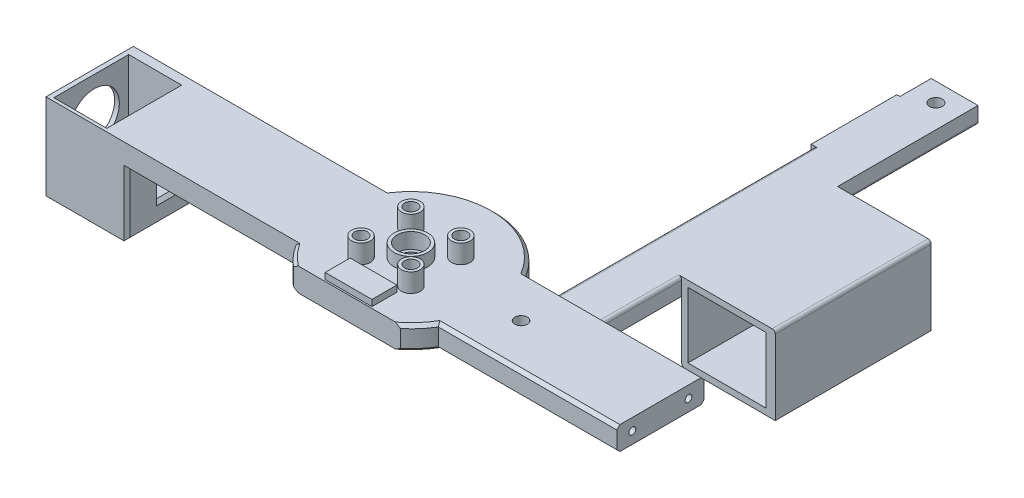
ISO-10303-21;
HEADER;
FILE_DESCRIPTION(('STEP AP214'),'2;1');
FILE_NAME('part.step','',(''),(''),'','','');
FILE_SCHEMA(('AUTOMOTIVE_DESIGN { 1 0 10303 214 1 1 1 1 }'));
ENDSEC;
DATA;
#1=APPLICATION_CONTEXT('core data for automotive mechanical design processes');
#2=APPLICATION_PROTOCOL_DEFINITION('international standard','automotive_design',2000,#1);
#3=PRODUCT_CONTEXT('',#1,'mechanical');
#4=PRODUCT('Part','Part','',(#3));
#5=PRODUCT_RELATED_PRODUCT_CATEGORY('part','',(#4));
#6=PRODUCT_DEFINITION_FORMATION('','',#4);
#7=PRODUCT_DEFINITION_CONTEXT('part definition',#1,'design');
#8=PRODUCT_DEFINITION('design','',#6,#7);
#9=PRODUCT_DEFINITION_SHAPE('','',#8);
#10=(LENGTH_UNIT() NAMED_UNIT(*) SI_UNIT(.MILLI.,.METRE.));
#11=(NAMED_UNIT(*) PLANE_ANGLE_UNIT() SI_UNIT($,.RADIAN.));
#12=(NAMED_UNIT(*) SI_UNIT($,.STERADIAN.) SOLID_ANGLE_UNIT());
#13=UNCERTAINTY_MEASURE_WITH_UNIT(LENGTH_MEASURE(1.E-05),#10,'distance_accuracy_value','');
#14=(GEOMETRIC_REPRESENTATION_CONTEXT(3) GLOBAL_UNCERTAINTY_ASSIGNED_CONTEXT((#13)) GLOBAL_UNIT_ASSIGNED_CONTEXT((#10,
#11,#12)) REPRESENTATION_CONTEXT('',''));
#15=CARTESIAN_POINT('',(0.,0.,0.));
#16=DIRECTION('',(0.,0.,1.));
#17=DIRECTION('',(1.,0.,0.));
#18=AXIS2_PLACEMENT_3D('',#15,#16,#17);
#19=CARTESIAN_POINT('',(0.,7.5,0.));
#20=DIRECTION('',(0.,1.,0.));
#21=DIRECTION('',(0.,0.,1.));
#22=AXIS2_PLACEMENT_3D('',#19,#20,#21);
#23=PLANE('',#22);
#24=DIRECTION('',(1.,0.,0.));
#25=VECTOR('',#24,1.);
#26=CARTESIAN_POINT('',(-50.,7.5,-14.));
#27=LINE('',#26,#25);
#28=CARTESIAN_POINT('',(-103.,7.5,-14.));
#29=VERTEX_POINT('',#28);
#30=CARTESIAN_POINT('',(-21.6195462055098,7.5,-14.));
#31=VERTEX_POINT('',#30);
#32=EDGE_CURVE('E666',#29,#31,#27,.T.);
#33=ORIENTED_EDGE('',*,*,#32,.F.);
#34=DIRECTION('',(0.,0.,-1.));
#35=VECTOR('',#34,1.);
#36=CARTESIAN_POINT('',(-103.,7.5,-14.));
#37=LINE('',#36,#35);
#38=CARTESIAN_POINT('',(-103.,7.5,14.));
#39=VERTEX_POINT('',#38);
#40=EDGE_CURVE('E546',#39,#29,#37,.T.);
#41=ORIENTED_EDGE('',*,*,#40,.F.);
#42=DIRECTION('',(-1.,0.,0.));
#43=VECTOR('',#42,1.);
#44=CARTESIAN_POINT('',(-50.,7.5,14.));
#45=LINE('',#44,#43);
#46=CARTESIAN_POINT('',(-21.6195462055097,7.5,14.));
#47=VERTEX_POINT('',#46);
#48=EDGE_CURVE('E660',#47,#39,#45,.T.);
#49=ORIENTED_EDGE('',*,*,#48,.F.);
#50=CARTESIAN_POINT('',(0.,7.5,0.));
#51=DIRECTION('',(0.,1.,0.));
#52=DIRECTION('',(0.,0.,1.));
#53=AXIS2_PLACEMENT_3D('',#50,#51,#52);
#54=CIRCLE('',#53,25.7566453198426);
#55=CARTESIAN_POINT('',(-15.569525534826,7.5,20.5181542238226));
#56=VERTEX_POINT('',#55);
#57=EDGE_CURVE('E701',#47,#56,#54,.T.);
#58=ORIENTED_EDGE('',*,*,#57,.T.);
#59=DIRECTION('',(-1.,0.,0.));
#60=VECTOR('',#59,1.);
#61=CARTESIAN_POINT('',(-29.8361664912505,7.5,20.5181542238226));
#62=LINE('',#61,#60);
#63=CARTESIAN_POINT('',(15.569525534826,7.5,20.5181542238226));
#64=VERTEX_POINT('',#63);
#65=EDGE_CURVE('E286',#64,#56,#62,.T.);
#66=ORIENTED_EDGE('',*,*,#65,.F.);
#67=CARTESIAN_POINT('',(22.2352148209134,7.5,13.));
#68=VERTEX_POINT('',#67);
#69=EDGE_CURVE('E700',#64,#68,#54,.T.);
#70=ORIENTED_EDGE('',*,*,#69,.T.);
#71=DIRECTION('',(1.,0.,0.));
#72=VECTOR('',#71,1.);
#73=CARTESIAN_POINT('',(80.,7.5,13.));
#74=LINE('',#73,#72);
#75=CARTESIAN_POINT('',(80.,7.5,13.));
#76=VERTEX_POINT('',#75);
#77=EDGE_CURVE('E697',#68,#76,#74,.T.);
#78=ORIENTED_EDGE('',*,*,#77,.T.);
#79=DIRECTION('',(0.,0.,1.));
#80=VECTOR('',#79,1.);
#81=CARTESIAN_POINT('',(80.,7.5,-14.));
#82=LINE('',#81,#80);
#83=CARTESIAN_POINT('',(80.,7.5,-13.));
#84=VERTEX_POINT('',#83);
#85=EDGE_CURVE('E663',#84,#76,#82,.T.);
#86=ORIENTED_EDGE('',*,*,#85,.F.);
#87=DIRECTION('',(-1.,0.,0.));
#88=VECTOR('',#87,1.);
#89=CARTESIAN_POINT('',(0.,7.5,-13.));
#90=LINE('',#89,#88);
#91=CARTESIAN_POINT('',(22.2352148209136,7.5,-13.));
#92=VERTEX_POINT('',#91);
#93=EDGE_CURVE('E694',#84,#92,#90,.T.);
#94=ORIENTED_EDGE('',*,*,#93,.T.);
#95=CARTESIAN_POINT('',(0.,7.5,0.));
#96=DIRECTION('',(0.,1.,0.));
#97=DIRECTION('',(0.,0.,1.));
#98=AXIS2_PLACEMENT_3D('',#95,#96,#97);
#99=CIRCLE('',#98,25.7566453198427);
#100=EDGE_CURVE('E689',#92,#31,#99,.T.);
#101=ORIENTED_EDGE('',*,*,#100,.T.);
#102=EDGE_LOOP('',(#33,#41,#49,#58,#66,#70,#78,#86,#94,#101));
#103=FACE_BOUND('',#102,.T.);
#104=DIRECTION('',(0.,0.,-1.));
#105=VECTOR('',#104,1.);
#106=CARTESIAN_POINT('',(-101.5,7.5,13.));
#107=LINE('',#106,#105);
#108=CARTESIAN_POINT('',(-101.5,7.5,13.));
#109=VERTEX_POINT('',#108);
#110=CARTESIAN_POINT('',(-101.5,7.5,-11.));
#111=VERTEX_POINT('',#110);
#112=EDGE_CURVE('E522',#109,#111,#107,.T.);
#113=ORIENTED_EDGE('',*,*,#112,.T.);
#114=DIRECTION('',(1.,0.,0.));
#115=VECTOR('',#114,1.);
#116=CARTESIAN_POINT('',(-103.,7.5,-11.));
#117=LINE('',#116,#115);
#118=CARTESIAN_POINT('',(-84.5,7.5,-11.));
#119=VERTEX_POINT('',#118);
#120=EDGE_CURVE('E280',#111,#119,#117,.T.);
#121=ORIENTED_EDGE('',*,*,#120,.T.);
#122=DIRECTION('',(0.,0.,-1.));
#123=VECTOR('',#122,1.);
#124=CARTESIAN_POINT('',(-84.5,7.5,13.));
#125=LINE('',#124,#123);
#126=CARTESIAN_POINT('',(-84.5,7.5,13.));
#127=VERTEX_POINT('',#126);
#128=EDGE_CURVE('E515',#127,#119,#125,.T.);
#129=ORIENTED_EDGE('',*,*,#128,.F.);
#130=DIRECTION('',(1.,0.,0.));
#131=VECTOR('',#130,1.);
#132=CARTESIAN_POINT('',(-84.5,7.5,13.));
#133=LINE('',#132,#131);
#134=EDGE_CURVE('E533',#109,#127,#133,.T.);
#135=ORIENTED_EDGE('',*,*,#134,.F.);
#136=EDGE_LOOP('',(#113,#121,#129,#135));
#137=FACE_BOUND('',#136,.T.);
#138=CARTESIAN_POINT('',(35.3024782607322,7.5,0.));
#139=DIRECTION('',(0.,1.,0.));
#140=DIRECTION('',(0.,0.,1.));
#141=AXIS2_PLACEMENT_3D('',#138,#139,#140);
#142=CIRCLE('',#141,2.);
#143=CARTESIAN_POINT('',(35.3024782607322,7.5,2.));
#144=VERTEX_POINT('',#143);
#145=EDGE_CURVE('E552',#144,#144,#142,.T.);
#146=ORIENTED_EDGE('',*,*,#145,.F.);
#147=EDGE_LOOP('',(#146));
#148=FACE_BOUND('',#147,.T.);
#149=CARTESIAN_POINT('',(-8.,7.5,-8.));
#150=DIRECTION('',(0.,1.,0.));
#151=DIRECTION('',(0.,0.,1.));
#152=AXIS2_PLACEMENT_3D('',#149,#150,#151);
#153=CIRCLE('',#152,3.);
#154=CARTESIAN_POINT('',(-8.,7.5,-5.));
#155=VERTEX_POINT('',#154);
#156=EDGE_CURVE('E597',#155,#155,#153,.T.);
#157=ORIENTED_EDGE('',*,*,#156,.F.);
#158=EDGE_LOOP('',(#157));
#159=FACE_BOUND('',#158,.T.);
#160=CARTESIAN_POINT('',(8.,7.5,-8.));
#161=DIRECTION('',(0.,1.,0.));
#162=DIRECTION('',(0.,0.,1.));
#163=AXIS2_PLACEMENT_3D('',#160,#161,#162);
#164=CIRCLE('',#163,3.);
#165=CARTESIAN_POINT('',(8.,7.5,-5.));
#166=VERTEX_POINT('',#165);
#167=EDGE_CURVE('E586',#166,#166,#164,.T.);
#168=ORIENTED_EDGE('',*,*,#167,.F.);
#169=EDGE_LOOP('',(#168));
#170=FACE_BOUND('',#169,.T.);
#171=CARTESIAN_POINT('',(-8.,7.5,8.));
#172=DIRECTION('',(0.,1.,0.));
#173=DIRECTION('',(0.,0.,1.));
#174=AXIS2_PLACEMENT_3D('',#171,#172,#173);
#175=CIRCLE('',#174,3.);
#176=CARTESIAN_POINT('',(-8.,7.5,11.));
#177=VERTEX_POINT('',#176);
#178=EDGE_CURVE('E577',#177,#177,#175,.T.);
#179=ORIENTED_EDGE('',*,*,#178,.F.);
#180=EDGE_LOOP('',(#179));
#181=FACE_BOUND('',#180,.T.);
#182=CARTESIAN_POINT('',(8.,7.5,8.));
#183=DIRECTION('',(0.,1.,0.));
#184=DIRECTION('',(0.,0.,1.));
#185=AXIS2_PLACEMENT_3D('',#182,#183,#184);
#186=CIRCLE('',#185,3.);
#187=CARTESIAN_POINT('',(8.,7.5,11.));
#188=VERTEX_POINT('',#187);
#189=EDGE_CURVE('E568',#188,#188,#186,.T.);
#190=ORIENTED_EDGE('',*,*,#189,.F.);
#191=EDGE_LOOP('',(#190));
#192=FACE_BOUND('',#191,.T.);
#193=CARTESIAN_POINT('',(0.,7.5,0.));
#194=DIRECTION('',(0.,1.,0.));
#195=DIRECTION('',(0.,0.,1.));
#196=AXIS2_PLACEMENT_3D('',#193,#194,#195);
#197=CIRCLE('',#196,5.4);
#198=CARTESIAN_POINT('',(0.,7.5,5.4));
#199=VERTEX_POINT('',#198);
#200=EDGE_CURVE('E561',#199,#199,#197,.T.);
#201=ORIENTED_EDGE('',*,*,#200,.F.);
#202=EDGE_LOOP('',(#201));
#203=FACE_BOUND('',#202,.T.);
#204=DIRECTION('',(-1.,0.,0.));
#205=VECTOR('',#204,1.);
#206=CARTESIAN_POINT('',(-7.5,7.5,12.));
#207=LINE('',#206,#205);
#208=CARTESIAN_POINT('',(7.5,7.5,12.));
#209=VERTEX_POINT('',#208);
#210=CARTESIAN_POINT('',(-7.5,7.5,12.));
#211=VERTEX_POINT('',#210);
#212=EDGE_CURVE('E2530',#209,#211,#207,.T.);
#213=ORIENTED_EDGE('',*,*,#212,.F.);
#214=DIRECTION('',(0.,0.,-1.));
#215=VECTOR('',#214,1.);
#216=CARTESIAN_POINT('',(7.5,7.5,12.));
#217=LINE('',#216,#215);
#218=CARTESIAN_POINT('',(7.5,7.5,20.));
#219=VERTEX_POINT('',#218);
#220=EDGE_CURVE('E2515',#219,#209,#217,.T.);
#221=ORIENTED_EDGE('',*,*,#220,.F.);
#222=DIRECTION('',(1.,0.,0.));
#223=VECTOR('',#222,1.);
#224=CARTESIAN_POINT('',(-7.5,7.5,20.));
#225=LINE('',#224,#223);
#226=CARTESIAN_POINT('',(-7.5,7.5,20.));
#227=VERTEX_POINT('',#226);
#228=EDGE_CURVE('E2509',#227,#219,#225,.T.);
#229=ORIENTED_EDGE('',*,*,#228,.F.);
#230=DIRECTION('',(0.,0.,1.));
#231=VECTOR('',#230,1.);
#232=CARTESIAN_POINT('',(-7.5,7.5,12.));
#233=LINE('',#232,#231);
#234=EDGE_CURVE('E2528',#211,#227,#233,.T.);
#235=ORIENTED_EDGE('',*,*,#234,.F.);
#236=EDGE_LOOP('',(#213,#221,#229,#235));
#237=FACE_BOUND('',#236,.T.);
#238=ADVANCED_FACE('F39',(#103,#137,#148,#159,#170,#181,#192,#203,#237),#23,.T.);
#239=CARTESIAN_POINT('',(40.3017119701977,-3.50000000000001,-128.));
#240=DIRECTION('',(0.,1.,0.));
#241=DIRECTION('',(0.,0.,1.));
#242=AXIS2_PLACEMENT_3D('',#239,#240,#241);
#243=CYLINDRICAL_SURFACE('',#242,2.04999999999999);
#244=CARTESIAN_POINT('',(40.3017119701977,6.49999999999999,-128.));
#245=DIRECTION('',(0.,1.,0.));
#246=DIRECTION('',(0.,0.,1.));
#247=AXIS2_PLACEMENT_3D('',#244,#245,#246);
#248=CIRCLE('',#247,2.04999999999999);
#249=CARTESIAN_POINT('',(40.3017119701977,6.49999999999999,-125.95));
#250=VERTEX_POINT('',#249);
#251=EDGE_CURVE('E1033',#250,#250,#248,.T.);
#252=ORIENTED_EDGE('',*,*,#251,.T.);
#253=EDGE_LOOP('',(#252));
#254=FACE_BOUND('',#253,.T.);
#255=CARTESIAN_POINT('',(40.3017119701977,3.6,-128.));
#256=DIRECTION('',(0.,-1.,0.));
#257=DIRECTION('',(0.,0.,-1.));
#258=AXIS2_PLACEMENT_3D('',#255,#256,#257);
#259=CIRCLE('',#258,2.04999999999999);
#260=CARTESIAN_POINT('',(40.3017119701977,3.6,-130.05));
#261=VERTEX_POINT('',#260);
#262=EDGE_CURVE('E1031',#261,#261,#259,.F.);
#263=ORIENTED_EDGE('',*,*,#262,.F.);
#264=EDGE_LOOP('',(#263));
#265=FACE_BOUND('',#264,.T.);
#266=ADVANCED_FACE('F437',(#254,#265),#243,.F.);
#267=CARTESIAN_POINT('',(32.8017119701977,6.49999999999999,-134.));
#268=DIRECTION('',(1.,0.,0.));
#269=DIRECTION('',(0.,0.,-1.));
#270=AXIS2_PLACEMENT_3D('',#267,#268,#269);
#271=PLANE('',#270);
#272=DIRECTION('',(0.,-1.,0.));
#273=VECTOR('',#272,1.);
#274=CARTESIAN_POINT('',(32.8017119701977,6.49999999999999,-124.));
#275=LINE('',#274,#273);
#276=CARTESIAN_POINT('',(32.8017119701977,6.49999999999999,-124.));
#277=VERTEX_POINT('',#276);
#278=CARTESIAN_POINT('',(32.8017119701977,1.,-124.));
#279=VERTEX_POINT('',#278);
#280=EDGE_CURVE('E1038',#277,#279,#275,.T.);
#281=ORIENTED_EDGE('',*,*,#280,.F.);
#282=DIRECTION('',(0.,0.,1.));
#283=VECTOR('',#282,1.);
#284=CARTESIAN_POINT('',(32.8017119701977,6.49999999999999,-134.));
#285=LINE('',#284,#283);
#286=CARTESIAN_POINT('',(32.8017119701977,6.49999999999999,-134.));
#287=VERTEX_POINT('',#286);
#288=EDGE_CURVE('E268',#287,#277,#285,.T.);
#289=ORIENTED_EDGE('',*,*,#288,.F.);
#290=DIRECTION('',(0.,1.,0.));
#291=VECTOR('',#290,1.);
#292=CARTESIAN_POINT('',(32.8017119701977,6.49999999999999,-134.));
#293=LINE('',#292,#291);
#294=CARTESIAN_POINT('',(32.8017119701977,1.,-134.));
#295=VERTEX_POINT('',#294);
#296=EDGE_CURVE('E255',#295,#287,#293,.T.);
#297=ORIENTED_EDGE('',*,*,#296,.F.);
#298=DIRECTION('',(0.,0.,1.));
#299=VECTOR('',#298,1.);
#300=CARTESIAN_POINT('',(32.8017119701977,1.,-134.));
#301=LINE('',#300,#299);
#302=EDGE_CURVE('E271',#295,#279,#301,.T.);
#303=ORIENTED_EDGE('',*,*,#302,.T.);
#304=EDGE_LOOP('',(#281,#289,#297,#303));
#305=FACE_BOUND('',#304,.T.);
#306=ADVANCED_FACE('F445',(#305),#271,.F.);
#307=DIRECTION('',(0.,1.,0.));
#308=VECTOR('',#307,1.);
#309=CARTESIAN_POINT('',(32.8017119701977,6.49999999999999,-14.));
#310=LINE('',#309,#308);
#311=CARTESIAN_POINT('',(32.8017119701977,1.,-14.));
#312=VERTEX_POINT('',#311);
#313=CARTESIAN_POINT('',(32.8017119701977,5.49999999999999,-14.));
#314=VERTEX_POINT('',#313);
#315=EDGE_CURVE('E186',#312,#314,#310,.T.);
#316=ORIENTED_EDGE('',*,*,#315,.T.);
#317=DIRECTION('',(0.,0.,1.));
#318=VECTOR('',#317,1.);
#319=CARTESIAN_POINT('',(32.8017119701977,5.49999999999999,-134.));
#320=LINE('',#319,#318);
#321=CARTESIAN_POINT('',(32.8017119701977,5.49999999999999,-96.5));
#322=VERTEX_POINT('',#321);
#323=EDGE_CURVE('E196',#314,#322,#320,.F.);
#324=ORIENTED_EDGE('',*,*,#323,.T.);
#325=DIRECTION('',(0.,1.,0.));
#326=VECTOR('',#325,1.);
#327=CARTESIAN_POINT('',(32.8017119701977,6.49999999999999,-96.5));
#328=LINE('',#327,#326);
#329=CARTESIAN_POINT('',(32.8017119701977,1.,-96.5));
#330=VERTEX_POINT('',#329);
#331=EDGE_CURVE('E1055',#330,#322,#328,.T.);
#332=ORIENTED_EDGE('',*,*,#331,.F.);
#333=EDGE_CURVE('E199',#330,#312,#301,.T.);
#334=ORIENTED_EDGE('',*,*,#333,.T.);
#335=EDGE_LOOP('',(#316,#324,#332,#334));
#336=FACE_BOUND('',#335,.T.);
#337=ADVANCED_FACE('F194',(#336),#271,.F.);
#338=CARTESIAN_POINT('',(47.8017119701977,6.49999999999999,-134.));
#339=DIRECTION('',(-1.,0.,0.));
#340=DIRECTION('',(0.,0.,1.));
#341=AXIS2_PLACEMENT_3D('',#338,#339,#340);
#342=PLANE('',#341);
#343=DIRECTION('',(0.,-1.,0.));
#344=VECTOR('',#343,1.);
#345=CARTESIAN_POINT('',(47.8017119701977,6.49999999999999,-39.));
#346=LINE('',#345,#344);
#347=CARTESIAN_POINT('',(47.8017119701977,5.49999999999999,-39.));
#348=VERTEX_POINT('',#347);
#349=CARTESIAN_POINT('',(47.8017119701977,1.,-39.));
#350=VERTEX_POINT('',#349);
#351=EDGE_CURVE('E163',#348,#350,#346,.T.);
#352=ORIENTED_EDGE('',*,*,#351,.F.);
#353=DIRECTION('',(0.,0.,1.));
#354=VECTOR('',#353,1.);
#355=CARTESIAN_POINT('',(47.8017119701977,5.49999999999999,-134.));
#356=LINE('',#355,#354);
#357=CARTESIAN_POINT('',(47.8017119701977,5.49999999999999,-14.));
#358=VERTEX_POINT('',#357);
#359=EDGE_CURVE('E1030',#348,#358,#356,.T.);
#360=ORIENTED_EDGE('',*,*,#359,.T.);
#361=DIRECTION('',(0.,-1.,0.));
#362=VECTOR('',#361,1.);
#363=CARTESIAN_POINT('',(47.8017119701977,6.49999999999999,-14.));
#364=LINE('',#363,#362);
#365=CARTESIAN_POINT('',(47.8017119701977,1.,-14.));
#366=VERTEX_POINT('',#365);
#367=EDGE_CURVE('E243',#358,#366,#364,.T.);
#368=ORIENTED_EDGE('',*,*,#367,.T.);
#369=DIRECTION('',(0.,0.,1.));
#370=VECTOR('',#369,1.);
#371=CARTESIAN_POINT('',(47.8017119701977,1.,-134.));
#372=LINE('',#371,#370);
#373=EDGE_CURVE('E274',#350,#366,#372,.T.);
#374=ORIENTED_EDGE('',*,*,#373,.F.);
#375=EDGE_LOOP('',(#352,#360,#368,#374));
#376=FACE_BOUND('',#375,.T.);
#377=ADVANCED_FACE('F1491',(#376),#342,.F.);
#378=DIRECTION('',(0.,1.,0.));
#379=VECTOR('',#378,1.);
#380=CARTESIAN_POINT('',(47.8017119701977,6.49999999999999,-89.));
#381=LINE('',#380,#379);
#382=CARTESIAN_POINT('',(47.8017119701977,2.,-89.));
#383=VERTEX_POINT('',#382);
#384=CARTESIAN_POINT('',(47.8017119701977,6.49999999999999,-89.));
#385=VERTEX_POINT('',#384);
#386=EDGE_CURVE('E989',#383,#385,#381,.T.);
#387=ORIENTED_EDGE('',*,*,#386,.F.);
#388=DIRECTION('',(0.,0.,1.));
#389=VECTOR('',#388,1.);
#390=CARTESIAN_POINT('',(47.8017119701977,2.,-134.));
#391=LINE('',#390,#389);
#392=CARTESIAN_POINT('',(47.8017119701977,2.,-134.));
#393=VERTEX_POINT('',#392);
#394=EDGE_CURVE('E212',#383,#393,#391,.F.);
#395=ORIENTED_EDGE('',*,*,#394,.T.);
#396=DIRECTION('',(0.,-1.,0.));
#397=VECTOR('',#396,1.);
#398=CARTESIAN_POINT('',(47.8017119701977,6.49999999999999,-134.));
#399=LINE('',#398,#397);
#400=CARTESIAN_POINT('',(47.8017119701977,6.49999999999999,-134.));
#401=VERTEX_POINT('',#400);
#402=EDGE_CURVE('E249',#401,#393,#399,.T.);
#403=ORIENTED_EDGE('',*,*,#402,.F.);
#404=DIRECTION('',(0.,0.,1.));
#405=VECTOR('',#404,1.);
#406=CARTESIAN_POINT('',(47.8017119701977,6.49999999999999,-134.));
#407=LINE('',#406,#405);
#408=EDGE_CURVE('E261',#401,#385,#407,.T.);
#409=ORIENTED_EDGE('',*,*,#408,.T.);
#410=EDGE_LOOP('',(#387,#395,#403,#409));
#411=FACE_BOUND('',#410,.T.);
#412=ADVANCED_FACE('F846',(#411),#342,.F.);
#413=CARTESIAN_POINT('',(22.8017119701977,7.5,-14.));
#414=DIRECTION('',(0.,0.,-1.));
#415=DIRECTION('',(-1.,0.,0.));
#416=AXIS2_PLACEMENT_3D('',#413,#414,#415);
#417=PLANE('',#416);
#418=DIRECTION('',(-1.,0.,0.));
#419=VECTOR('',#418,1.);
#420=CARTESIAN_POINT('',(22.8017119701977,1.,-14.));
#421=LINE('',#420,#419);
#422=CARTESIAN_POINT('',(80.,1.,-14.));
#423=VERTEX_POINT('',#422);
#424=EDGE_CURVE('E731',#423,#366,#421,.T.);
#425=ORIENTED_EDGE('',*,*,#424,.T.);
#426=ORIENTED_EDGE('',*,*,#367,.F.);
#427=CARTESIAN_POINT('',(46.8017119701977,5.49999999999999,-14.));
#428=DIRECTION('',(0.,0.,-1.));
#429=DIRECTION('',(-1.,0.,0.));
#430=AXIS2_PLACEMENT_3D('',#427,#428,#429);
#431=CIRCLE('',#430,1.);
#432=CARTESIAN_POINT('',(46.8017119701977,6.49999999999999,-14.));
#433=VERTEX_POINT('',#432);
#434=EDGE_CURVE('E89',#358,#433,#431,.F.);
#435=ORIENTED_EDGE('',*,*,#434,.T.);
#436=DIRECTION('',(1.,0.,0.));
#437=VECTOR('',#436,1.);
#438=CARTESIAN_POINT('',(22.8017119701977,6.49999999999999,-14.));
#439=LINE('',#438,#437);
#440=CARTESIAN_POINT('',(80.,6.49999999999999,-14.));
#441=VERTEX_POINT('',#440);
#442=EDGE_CURVE('E63',#433,#441,#439,.T.);
#443=ORIENTED_EDGE('',*,*,#442,.T.);
#444=DIRECTION('',(0.,-1.,0.));
#445=VECTOR('',#444,1.);
#446=CARTESIAN_POINT('',(80.,7.5,-14.));
#447=LINE('',#446,#445);
#448=EDGE_CURVE('E677',#441,#423,#447,.T.);
#449=ORIENTED_EDGE('',*,*,#448,.T.);
#450=EDGE_LOOP('',(#425,#426,#435,#443,#449));
#451=FACE_BOUND('',#450,.T.);
#452=ADVANCED_FACE('F843',(#451),#417,.T.);
#453=CARTESIAN_POINT('',(22.8017119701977,6.49999999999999,-14.));
#454=VERTEX_POINT('',#453);
#455=CARTESIAN_POINT('',(33.8017119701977,6.49999999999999,-14.));
#456=VERTEX_POINT('',#455);
#457=EDGE_CURVE('E77',#454,#456,#439,.T.);
#458=ORIENTED_EDGE('',*,*,#457,.T.);
#459=CARTESIAN_POINT('',(33.8017119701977,5.49999999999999,-14.));
#460=DIRECTION('',(0.,0.,-1.));
#461=DIRECTION('',(-1.,0.,0.));
#462=AXIS2_PLACEMENT_3D('',#459,#460,#461);
#463=CIRCLE('',#462,1.);
#464=EDGE_CURVE('E47',#456,#314,#463,.F.);
#465=ORIENTED_EDGE('',*,*,#464,.T.);
#466=ORIENTED_EDGE('',*,*,#315,.F.);
#467=CARTESIAN_POINT('',(22.8017119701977,0.999999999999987,-14.));
#468=VERTEX_POINT('',#467);
#469=EDGE_CURVE('E730',#312,#468,#421,.T.);
#470=ORIENTED_EDGE('',*,*,#469,.T.);
#471=DIRECTION('',(0.,-1.,0.));
#472=VECTOR('',#471,1.);
#473=CARTESIAN_POINT('',(22.8017119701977,7.5,-14.));
#474=LINE('',#473,#472);
#475=EDGE_CURVE('E674',#454,#468,#474,.T.);
#476=ORIENTED_EDGE('',*,*,#475,.F.);
#477=EDGE_LOOP('',(#458,#465,#466,#470,#476));
#478=FACE_BOUND('',#477,.T.);
#479=ADVANCED_FACE('F183',(#478),#417,.T.);
#480=CARTESIAN_POINT('',(-84.5,7.5,13.));
#481=DIRECTION('',(1.,0.,0.));
#482=DIRECTION('',(0.,0.,-1.));
#483=AXIS2_PLACEMENT_3D('',#480,#481,#482);
#484=PLANE('',#483);
#485=CARTESIAN_POINT('',(-84.5,-4.5,0.));
#486=DIRECTION('',(1.,0.,0.));
#487=DIRECTION('',(0.,0.,-1.));
#488=AXIS2_PLACEMENT_3D('',#485,#486,#487);
#489=CIRCLE('',#488,2.1);
#490=CARTESIAN_POINT('',(-84.5,-4.5,-2.1));
#491=VERTEX_POINT('',#490);
#492=EDGE_CURVE('E512',#491,#491,#489,.F.);
#493=ORIENTED_EDGE('',*,*,#492,.F.);
#494=EDGE_LOOP('',(#493));
#495=FACE_BOUND('',#494,.T.);
#496=DIRECTION('',(0.,1.,0.));
#497=VECTOR('',#496,1.);
#498=CARTESIAN_POINT('',(-84.5,7.5,-11.));
#499=LINE('',#498,#497);
#500=CARTESIAN_POINT('',(-84.5,-20.,-11.));
#501=VERTEX_POINT('',#500);
#502=EDGE_CURVE('E277',#501,#119,#499,.T.);
#503=ORIENTED_EDGE('',*,*,#502,.F.);
#504=DIRECTION('',(0.,0.,-1.));
#505=VECTOR('',#504,1.);
#506=CARTESIAN_POINT('',(-84.5,-20.,13.));
#507=LINE('',#506,#505);
#508=CARTESIAN_POINT('',(-84.5,-20.,13.));
#509=VERTEX_POINT('',#508);
#510=EDGE_CURVE('E538',#509,#501,#507,.T.);
#511=ORIENTED_EDGE('',*,*,#510,.F.);
#512=DIRECTION('',(0.,-1.,0.));
#513=VECTOR('',#512,1.);
#514=CARTESIAN_POINT('',(-84.5,7.5,13.));
#515=LINE('',#514,#513);
#516=EDGE_CURVE('E1305',#127,#509,#515,.T.);
#517=ORIENTED_EDGE('',*,*,#516,.F.);
#518=ORIENTED_EDGE('',*,*,#128,.T.);
#519=EDGE_LOOP('',(#503,#511,#517,#518));
#520=FACE_BOUND('',#519,.T.);
#521=ADVANCED_FACE('F1336',(#495,#520),#484,.F.);
#522=CARTESIAN_POINT('',(-101.5,7.5,13.));
#523=DIRECTION('',(-1.,0.,0.));
#524=DIRECTION('',(0.,0.,1.));
#525=AXIS2_PLACEMENT_3D('',#522,#523,#524);
#526=PLANE('',#525);
#527=CARTESIAN_POINT('',(-101.5,-4.5,0.));
#528=DIRECTION('',(-1.,0.,0.));
#529=DIRECTION('',(0.,0.,1.));
#530=AXIS2_PLACEMENT_3D('',#527,#528,#529);
#531=CIRCLE('',#530,8.);
#532=CARTESIAN_POINT('',(-101.5,-4.5,8.));
#533=VERTEX_POINT('',#532);
#534=EDGE_CURVE('E335',#533,#533,#531,.T.);
#535=ORIENTED_EDGE('',*,*,#534,.T.);
#536=EDGE_LOOP('',(#535));
#537=FACE_BOUND('',#536,.T.);
#538=DIRECTION('',(0.,-1.,0.));
#539=VECTOR('',#538,1.);
#540=CARTESIAN_POINT('',(-101.5,7.5,-11.));
#541=LINE('',#540,#539);
#542=CARTESIAN_POINT('',(-101.5,-20.,-11.));
#543=VERTEX_POINT('',#542);
#544=EDGE_CURVE('E337',#111,#543,#541,.T.);
#545=ORIENTED_EDGE('',*,*,#544,.F.);
#546=ORIENTED_EDGE('',*,*,#112,.F.);
#547=DIRECTION('',(0.,1.,0.));
#548=VECTOR('',#547,1.);
#549=CARTESIAN_POINT('',(-101.5,7.5,13.));
#550=LINE('',#549,#548);
#551=CARTESIAN_POINT('',(-101.5,-20.,13.));
#552=VERTEX_POINT('',#551);
#553=EDGE_CURVE('E1298',#552,#109,#550,.T.);
#554=ORIENTED_EDGE('',*,*,#553,.F.);
#555=DIRECTION('',(0.,0.,-1.));
#556=VECTOR('',#555,1.);
#557=CARTESIAN_POINT('',(-101.5,-20.,13.));
#558=LINE('',#557,#556);
#559=EDGE_CURVE('E530',#552,#543,#558,.T.);
#560=ORIENTED_EDGE('',*,*,#559,.T.);
#561=EDGE_LOOP('',(#545,#546,#554,#560));
#562=FACE_BOUND('',#561,.T.);
#563=ADVANCED_FACE('F1296',(#537,#562),#526,.F.);
#564=CARTESIAN_POINT('',(0.,7.5,0.));
#565=DIRECTION('',(0.,-1.,0.));
#566=DIRECTION('',(0.,0.,-1.));
#567=AXIS2_PLACEMENT_3D('',#564,#565,#566);
#568=CYLINDRICAL_SURFACE('',#567,26.7566453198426);
#569=CARTESIAN_POINT('',(0.,6.49999999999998,0.));
#570=DIRECTION('',(0.,1.,0.));
#571=DIRECTION('',(0.,0.,1.));
#572=AXIS2_PLACEMENT_3D('',#569,#570,#571);
#573=CIRCLE('',#572,26.7566453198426);
#574=CARTESIAN_POINT('',(22.8017119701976,6.49999999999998,14.));
#575=VERTEX_POINT('',#574);
#576=CARTESIAN_POINT('',(17.1733344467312,6.49999999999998,20.5181542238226));
#577=VERTEX_POINT('',#576);
#578=EDGE_CURVE('E709',#575,#577,#573,.F.);
#579=ORIENTED_EDGE('',*,*,#578,.T.);
#580=DIRECTION('',(0.,-1.,0.));
#581=VECTOR('',#580,1.);
#582=CARTESIAN_POINT('',(17.1733344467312,7.5,20.5181542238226));
#583=LINE('',#582,#581);
#584=CARTESIAN_POINT('',(17.1733344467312,0.999999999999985,20.5181542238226));
#585=VERTEX_POINT('',#584);
#586=EDGE_CURVE('E289',#577,#585,#583,.T.);
#587=ORIENTED_EDGE('',*,*,#586,.T.);
#588=CARTESIAN_POINT('',(0.,0.999999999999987,0.));
#589=DIRECTION('',(0.,1.,0.));
#590=DIRECTION('',(0.,0.,1.));
#591=AXIS2_PLACEMENT_3D('',#588,#589,#590);
#592=CIRCLE('',#591,26.7566453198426);
#593=CARTESIAN_POINT('',(22.8017119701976,0.999999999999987,14.));
#594=VERTEX_POINT('',#593);
#595=EDGE_CURVE('E704',#585,#594,#592,.T.);
#596=ORIENTED_EDGE('',*,*,#595,.T.);
#597=DIRECTION('',(0.,-1.,0.));
#598=VECTOR('',#597,1.);
#599=CARTESIAN_POINT('',(22.8017119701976,7.5,14.));
#600=LINE('',#599,#598);
#601=EDGE_CURVE('E683',#575,#594,#600,.T.);
#602=ORIENTED_EDGE('',*,*,#601,.F.);
#603=EDGE_LOOP('',(#579,#587,#596,#602));
#604=FACE_BOUND('',#603,.T.);
#605=ADVANCED_FACE('F834',(#604),#568,.T.);
#606=CARTESIAN_POINT('',(0.,7.5,0.));
#607=DIRECTION('',(0.,-1.,0.));
#608=DIRECTION('',(0.,0.,-1.));
#609=AXIS2_PLACEMENT_3D('',#606,#607,#608);
#610=CONICAL_SURFACE('',#609,25.7566453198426,0.785398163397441);
#611=CARTESIAN_POINT('',(17.1744250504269,6.49929999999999,20.5181542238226));
#612=CARTESIAN_POINT('',(16.7604710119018,6.76495654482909,20.5181542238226));
#613=CARTESIAN_POINT('',(16.3439598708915,7.02669001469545,20.5181542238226));
#614=CARTESIAN_POINT('',(15.5051814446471,7.54099048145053,20.5181542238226));
#615=CARTESIAN_POINT('',(15.0829127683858,7.7935552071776,20.5181542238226));
#616=CARTESIAN_POINT('',(14.2302153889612,8.28920804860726,20.5181542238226));
#617=CARTESIAN_POINT('',(13.7997580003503,8.53224699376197,20.5181542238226));
#618=CARTESIAN_POINT('',(12.9320620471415,9.00585794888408,20.5181542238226));
#619=CARTESIAN_POINT('',(12.4948239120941,9.23643074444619,20.5181542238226));
#620=CARTESIAN_POINT('',(11.6018380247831,9.68875594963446,20.5181542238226));
#621=CARTESIAN_POINT('',(11.1459016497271,9.91013876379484,20.5181542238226));
#622=CARTESIAN_POINT('',(10.2258420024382,10.3351279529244,20.5181542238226));
#623=CARTESIAN_POINT('',(9.76171822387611,10.5387332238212,20.5181542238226));
#624=CARTESIAN_POINT('',(8.35797568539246,11.1178809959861,20.5181542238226));
#625=CARTESIAN_POINT('',(7.40509893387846,11.4627365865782,20.5181542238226));
#626=CARTESIAN_POINT('',(5.83203587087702,11.9335217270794,20.5181542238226));
#627=CARTESIAN_POINT('',(5.22183524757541,12.0929746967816,20.5181542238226));
#628=CARTESIAN_POINT('',(3.99043373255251,12.3626827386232,20.5181542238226));
#629=CARTESIAN_POINT('',(3.36923262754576,12.4729368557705,20.5181542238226));
#630=CARTESIAN_POINT('',(2.12630506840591,12.6377029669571,20.5181542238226));
#631=CARTESIAN_POINT('',(1.50465875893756,12.692811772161,20.5181542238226));
#632=CARTESIAN_POINT('',(0.25892400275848,12.7462918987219,20.5181542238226));
#633=CARTESIAN_POINT('',(-0.365164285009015,12.7446668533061,20.5181542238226));
#634=CARTESIAN_POINT('',(-1.61066323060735,12.6847765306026,20.5181542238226));
#635=CARTESIAN_POINT('',(-2.23207347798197,12.6265028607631,20.5181542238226));
#636=CARTESIAN_POINT('',(-3.46750064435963,12.4565602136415,20.5181542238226));
#637=CARTESIAN_POINT('',(-4.0815167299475,12.3448852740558,20.5181542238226));
#638=CARTESIAN_POINT('',(-5.30522502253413,12.0722121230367,20.5181542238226));
#639=CARTESIAN_POINT('',(-5.91480155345,11.9107013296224,20.5181542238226));
#640=CARTESIAN_POINT('',(-7.12101099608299,11.5455222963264,20.5181542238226));
#641=CARTESIAN_POINT('',(-7.71764386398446,11.3418539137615,20.5181542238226));
#642=CARTESIAN_POINT('',(-9.09850318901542,10.8236473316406,20.5181542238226));
#643=CARTESIAN_POINT('',(-9.87741657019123,10.4949732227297,20.5181542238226));
#644=CARTESIAN_POINT('',(-11.0286181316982,9.96481948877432,20.5181542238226));
#645=CARTESIAN_POINT('',(-11.4096543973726,9.7818224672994,20.5181542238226));
#646=CARTESIAN_POINT('',(-12.1662872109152,9.40490445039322,20.5181542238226));
#647=CARTESIAN_POINT('',(-12.5418840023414,9.21098394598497,20.5181542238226));
#648=CARTESIAN_POINT('',(-13.2791440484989,8.81824699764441,20.5181542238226));
#649=CARTESIAN_POINT('',(-13.6409269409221,8.61965410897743,20.5181542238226));
#650=CARTESIAN_POINT('',(-14.3599488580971,8.21438878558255,20.5181542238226));
#651=CARTESIAN_POINT('',(-14.717187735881,8.00771609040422,20.5181542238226));
#652=CARTESIAN_POINT('',(-15.4266910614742,7.58767946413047,20.5181542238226));
#653=CARTESIAN_POINT('',(-15.7789643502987,7.37433043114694,20.5181542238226));
#654=CARTESIAN_POINT('',(-16.4795644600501,6.94134252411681,20.5181542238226));
#655=CARTESIAN_POINT('',(-16.8278917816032,6.72170446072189,20.5181542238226));
#656=CARTESIAN_POINT('',(-17.1744250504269,6.49929999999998,20.5181542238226));
#657=B_SPLINE_CURVE_WITH_KNOTS('',3,(#611,#612,#613,#614,#615,#616,#617,#618,#619,#620,#621,
#622,#623,#624,#625,#626,#627,#628,#629,#630,#631,#632,#633,#634,#635,#636,#637,#638,#639,#640,
#641,#642,#643,#644,#645,#646,#647,#648,#649,#650,#651,#652,#653,#654,#655,#656),.UNSPECIFIED.,
.F.,.F.,(4,2,2,2,2,2,2,2,2,2,2,2,2,2,2,2,2,2,2,2,2,2,4),(0.,1.47562218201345,2.95160742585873,
4.43441144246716,5.91712190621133,7.43726183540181,8.95749610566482,11.9916019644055,
13.8820185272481,15.772471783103,17.6422368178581,19.5118821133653,21.3818044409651,
23.2519355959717,25.1419818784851,27.0320345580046,29.5657791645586,30.8337675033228,
32.1016988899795,33.3397066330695,34.5777543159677,35.8132127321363,37.0485126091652),.UNSPECIFIED.);
#658=EDGE_CURVE('E295',#577,#64,#657,.T.);
#659=ORIENTED_EDGE('',*,*,#658,.F.);
#660=ORIENTED_EDGE('',*,*,#578,.F.);
#661=CARTESIAN_POINT('',(22.2352148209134,7.5,13.));
#662=CARTESIAN_POINT('',(22.3306543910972,7.33362318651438,13.1663768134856));
#663=CARTESIAN_POINT('',(22.4255822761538,7.16710143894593,13.3328985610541));
#664=CARTESIAN_POINT('',(22.6144146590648,6.83376810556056,13.6662318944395));
#665=CARTESIAN_POINT('',(22.7083191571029,6.66695651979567,13.8330434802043));
#666=CARTESIAN_POINT('',(22.8017119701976,6.49999999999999,14.));
#667=B_SPLINE_CURVE_WITH_KNOTS('',3,(#661,#662,#663,#664,#665,#666),.UNSPECIFIED.,.F.,.F.,(4,2,
4),(0.,0.761730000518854,1.52345986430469),.UNSPECIFIED.);
#668=EDGE_CURVE('E622',#575,#68,#667,.F.);
#669=ORIENTED_EDGE('',*,*,#668,.T.);
#670=ORIENTED_EDGE('',*,*,#69,.F.);
#671=EDGE_LOOP('',(#659,#660,#669,#670));
#672=FACE_BOUND('',#671,.T.);
#673=ADVANCED_FACE('F1272',(#672),#610,.T.);
#674=CARTESIAN_POINT('',(0.,0.999999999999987,0.));
#675=DIRECTION('',(0.,1.,0.));
#676=DIRECTION('',(0.,0.,1.));
#677=AXIS2_PLACEMENT_3D('',#674,#675,#676);
#678=CONICAL_SURFACE('',#677,26.7566453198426,0.785398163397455);
#679=CARTESIAN_POINT('',(-17.1744250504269,1.00069999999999,20.5181542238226));
#680=CARTESIAN_POINT('',(-16.7604710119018,0.735043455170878,20.5181542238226));
#681=CARTESIAN_POINT('',(-16.3439598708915,0.473309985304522,20.5181542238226));
#682=CARTESIAN_POINT('',(-15.505181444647,-0.0409904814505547,20.5181542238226));
#683=CARTESIAN_POINT('',(-15.0829127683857,-0.293555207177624,20.5181542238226));
#684=CARTESIAN_POINT('',(-14.2302153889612,-0.789208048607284,20.5181542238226));
#685=CARTESIAN_POINT('',(-13.7997580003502,-1.03224699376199,20.5181542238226));
#686=CARTESIAN_POINT('',(-12.9320620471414,-1.5058579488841,20.5181542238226));
#687=CARTESIAN_POINT('',(-12.494823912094,-1.73643074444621,20.5181542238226));
#688=CARTESIAN_POINT('',(-11.6018380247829,-2.18875594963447,20.5181542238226));
#689=CARTESIAN_POINT('',(-11.145901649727,-2.41013876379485,20.5181542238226));
#690=CARTESIAN_POINT('',(-10.2258420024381,-2.83512795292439,20.5181542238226));
#691=CARTESIAN_POINT('',(-9.76171822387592,-3.03873322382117,20.5181542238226));
#692=CARTESIAN_POINT('',(-8.35797568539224,-3.61788099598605,20.5181542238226));
#693=CARTESIAN_POINT('',(-7.40509893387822,-3.96273658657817,20.5181542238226));
#694=CARTESIAN_POINT('',(-5.83203587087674,-4.43352172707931,20.5181542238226));
#695=CARTESIAN_POINT('',(-5.22183524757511,-4.59297469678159,20.5181542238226));
#696=CARTESIAN_POINT('',(-3.99043373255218,-4.86268273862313,20.5181542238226));
#697=CARTESIAN_POINT('',(-3.36923262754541,-4.97293685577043,20.5181542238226));
#698=CARTESIAN_POINT('',(-2.12630506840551,-5.13770296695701,20.5181542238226));
#699=CARTESIAN_POINT('',(-1.50465875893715,-5.19281177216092,20.5181542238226));
#700=CARTESIAN_POINT('',(-0.258924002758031,-5.2462918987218,20.5181542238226));
#701=CARTESIAN_POINT('',(0.365164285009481,-5.2446668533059,20.5181542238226));
#702=CARTESIAN_POINT('',(1.61066323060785,-5.18477653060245,20.5181542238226));
#703=CARTESIAN_POINT('',(2.23207347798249,-5.12650286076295,20.5181542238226));
#704=CARTESIAN_POINT('',(3.46750064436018,-4.95656021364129,20.5181542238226));
#705=CARTESIAN_POINT('',(4.08151672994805,-4.84488527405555,20.5181542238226));
#706=CARTESIAN_POINT('',(5.30522502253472,-4.57221212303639,20.5181542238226));
#707=CARTESIAN_POINT('',(5.9148015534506,-4.41070132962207,20.5181542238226));
#708=CARTESIAN_POINT('',(7.12101099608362,-4.04552229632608,20.5181542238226));
#709=CARTESIAN_POINT('',(7.7176438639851,-3.84185391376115,20.5181542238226));
#710=CARTESIAN_POINT('',(9.098503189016,-3.32364733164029,20.5181542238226));
#711=CARTESIAN_POINT('',(9.87741657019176,-2.99497322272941,20.5181542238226));
#712=CARTESIAN_POINT('',(11.0286181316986,-2.46481948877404,20.5181542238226));
#713=CARTESIAN_POINT('',(11.409654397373,-2.28182246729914,20.5181542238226));
#714=CARTESIAN_POINT('',(12.1662872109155,-1.90490445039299,20.5181542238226));
#715=CARTESIAN_POINT('',(12.5418840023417,-1.71098394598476,20.5181542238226));
#716=CARTESIAN_POINT('',(13.2791440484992,-1.31824699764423,20.5181542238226));
#717=CARTESIAN_POINT('',(13.6409269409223,-1.11965410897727,20.5181542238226));
#718=CARTESIAN_POINT('',(14.3599488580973,-0.714388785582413,20.5181542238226));
#719=CARTESIAN_POINT('',(14.7171877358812,-0.507716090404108,20.5181542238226));
#720=CARTESIAN_POINT('',(15.4266910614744,-0.0876794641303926,20.5181542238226));
#721=CARTESIAN_POINT('',(15.7789643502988,0.125669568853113,20.5181542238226));
#722=CARTESIAN_POINT('',(16.4795644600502,0.558657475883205,20.5181542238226));
#723=CARTESIAN_POINT('',(16.8278917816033,0.778295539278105,20.5181542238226));
#724=CARTESIAN_POINT('',(17.1744250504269,1.00069999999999,20.5181542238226));
#725=B_SPLINE_CURVE_WITH_KNOTS('',3,(#679,#680,#681,#682,#683,#684,#685,#686,#687,#688,#689,
#690,#691,#692,#693,#694,#695,#696,#697,#698,#699,#700,#701,#702,#703,#704,#705,#706,#707,#708,
#709,#710,#711,#712,#713,#714,#715,#716,#717,#718,#719,#720,#721,#722,#723,#724),.UNSPECIFIED.,
.F.,.F.,(4,2,2,2,2,2,2,2,2,2,2,2,2,2,2,2,2,2,2,2,2,2,4),(0.,1.47562218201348,2.95160742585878,
4.43441144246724,5.91712190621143,7.43726183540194,8.95749610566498,11.9916019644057,
13.8820185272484,15.7724717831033,17.6422368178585,19.5118821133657,21.3818044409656,
23.2519355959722,25.1419818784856,27.0320345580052,29.565779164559,30.8337675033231,
32.1016988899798,33.3397066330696,34.5777543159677,35.8132127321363,37.048512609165),.UNSPECIFIED.);
#726=CARTESIAN_POINT('',(-17.1733344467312,0.999999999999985,20.5181542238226));
#727=VERTEX_POINT('',#726);
#728=CARTESIAN_POINT('',(-15.569525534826,0.,20.5181542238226));
#729=VERTEX_POINT('',#728);
#730=EDGE_CURVE('E333',#727,#729,#725,.T.);
#731=ORIENTED_EDGE('',*,*,#730,.F.);
#732=CARTESIAN_POINT('',(-22.8017119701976,0.999999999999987,14.));
#733=VERTEX_POINT('',#732);
#734=EDGE_CURVE('E705',#733,#727,#592,.T.);
#735=ORIENTED_EDGE('',*,*,#734,.F.);
#736=CARTESIAN_POINT('',(-22.2352148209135,0.,13.));
#737=CARTESIAN_POINT('',(-22.3306543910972,0.166376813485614,13.1663768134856));
#738=CARTESIAN_POINT('',(-22.4255822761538,0.332898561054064,13.3328985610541));
#739=CARTESIAN_POINT('',(-22.6144146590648,0.666231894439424,13.6662318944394));
#740=CARTESIAN_POINT('',(-22.7083191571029,0.833043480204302,13.8330434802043));
#741=CARTESIAN_POINT('',(-22.8017119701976,0.999999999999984,14.));
#742=B_SPLINE_CURVE_WITH_KNOTS('',3,(#736,#737,#738,#739,#740,#741),.UNSPECIFIED.,.F.,.F.,(4,2,
4),(0.,0.761730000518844,1.52345986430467),.UNSPECIFIED.);
#743=CARTESIAN_POINT('',(-22.2352148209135,0.,13.));
#744=VERTEX_POINT('',#743);
#745=EDGE_CURVE('E360',#744,#733,#742,.T.);
#746=ORIENTED_EDGE('',*,*,#745,.F.);
#747=CARTESIAN_POINT('',(0.,0.,0.));
#748=DIRECTION('',(0.,1.,0.));
#749=DIRECTION('',(0.,0.,1.));
#750=AXIS2_PLACEMENT_3D('',#747,#748,#749);
#751=CIRCLE('',#750,25.7566453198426);
#752=EDGE_CURVE('E744',#729,#744,#751,.F.);
#753=ORIENTED_EDGE('',*,*,#752,.F.);
#754=EDGE_LOOP('',(#731,#735,#746,#753));
#755=FACE_BOUND('',#754,.T.);
#756=ADVANCED_FACE('F352',(#755),#678,.T.);
#757=CARTESIAN_POINT('',(80.,7.5,-14.));
#758=DIRECTION('',(1.,0.,0.));
#759=DIRECTION('',(0.,0.,-1.));
#760=AXIS2_PLACEMENT_3D('',#757,#758,#759);
#761=PLANE('',#760);
#762=ORIENTED_EDGE('',*,*,#85,.T.);
#763=DIRECTION('',(0.,-0.707106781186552,0.707106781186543));
#764=VECTOR('',#763,1.);
#765=CARTESIAN_POINT('',(80.,21.,-0.49999999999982));
#766=LINE('',#765,#764);
#767=CARTESIAN_POINT('',(80.,6.49999999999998,14.));
#768=VERTEX_POINT('',#767);
#769=EDGE_CURVE('E721',#76,#768,#766,.T.);
#770=ORIENTED_EDGE('',*,*,#769,.T.);
#771=DIRECTION('',(0.,-1.,0.));
#772=VECTOR('',#771,1.);
#773=CARTESIAN_POINT('',(80.,7.5,14.));
#774=LINE('',#773,#772);
#775=CARTESIAN_POINT('',(80.,0.999999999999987,14.));
#776=VERTEX_POINT('',#775);
#777=EDGE_CURVE('E680',#768,#776,#774,.T.);
#778=ORIENTED_EDGE('',*,*,#777,.T.);
#779=DIRECTION('',(0.,0.707106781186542,0.707106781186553));
#780=VECTOR('',#779,1.);
#781=CARTESIAN_POINT('',(80.,-9.75000000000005,3.24999999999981));
#782=LINE('',#781,#780);
#783=CARTESIAN_POINT('',(80.,0.,13.));
#784=VERTEX_POINT('',#783);
#785=EDGE_CURVE('E712',#776,#784,#782,.F.);
#786=ORIENTED_EDGE('',*,*,#785,.T.);
#787=DIRECTION('',(0.,0.,1.));
#788=VECTOR('',#787,1.);
#789=CARTESIAN_POINT('',(80.,0.,-14.));
#790=LINE('',#789,#788);
#791=CARTESIAN_POINT('',(80.,0.,-13.));
#792=VERTEX_POINT('',#791);
#793=EDGE_CURVE('E657',#792,#784,#790,.T.);
#794=ORIENTED_EDGE('',*,*,#793,.F.);
#795=DIRECTION('',(0.,0.707106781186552,-0.707106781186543));
#796=VECTOR('',#795,1.);
#797=CARTESIAN_POINT('',(80.,4.25000000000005,-17.25));
#798=LINE('',#797,#796);
#799=EDGE_CURVE('E715',#792,#423,#798,.T.);
#800=ORIENTED_EDGE('',*,*,#799,.T.);
#801=ORIENTED_EDGE('',*,*,#448,.F.);
#802=DIRECTION('',(0.,-0.70710678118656,-0.707106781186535));
#803=VECTOR('',#802,1.);
#804=CARTESIAN_POINT('',(80.,7.00000000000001,-13.5));
#805=LINE('',#804,#803);
#806=EDGE_CURVE('E718',#441,#84,#805,.F.);
#807=ORIENTED_EDGE('',*,*,#806,.T.);
#808=EDGE_LOOP('',(#762,#770,#778,#786,#794,#800,#801,#807));
#809=FACE_BOUND('',#808,.T.);
#810=CARTESIAN_POINT('',(80.,3.75,9.));
#811=DIRECTION('',(1.,0.,0.));
#812=DIRECTION('',(0.,0.,-1.));
#813=AXIS2_PLACEMENT_3D('',#810,#811,#812);
#814=CIRCLE('',#813,1.1);
#815=CARTESIAN_POINT('',(80.,3.75,7.9));
#816=VERTEX_POINT('',#815);
#817=EDGE_CURVE('E613',#816,#816,#814,.T.);
#818=ORIENTED_EDGE('',*,*,#817,.F.);
#819=EDGE_LOOP('',(#818));
#820=FACE_BOUND('',#819,.T.);
#821=CARTESIAN_POINT('',(80.,3.75,-9.));
#822=DIRECTION('',(-1.,0.,0.));
#823=DIRECTION('',(0.,0.,1.));
#824=AXIS2_PLACEMENT_3D('',#821,#822,#823);
#825=CIRCLE('',#824,1.1);
#826=CARTESIAN_POINT('',(80.,3.75,-7.9));
#827=VERTEX_POINT('',#826);
#828=EDGE_CURVE('E610',#827,#827,#825,.T.);
#829=ORIENTED_EDGE('',*,*,#828,.T.);
#830=EDGE_LOOP('',(#829));
#831=FACE_BOUND('',#830,.T.);
#832=ADVANCED_FACE('F839',(#809,#820,#831),#761,.T.);
#833=CARTESIAN_POINT('',(0.,0.,0.));
#834=DIRECTION('',(0.,1.,0.));
#835=DIRECTION('',(0.,0.,1.));
#836=AXIS2_PLACEMENT_3D('',#833,#834,#835);
#837=PLANE('',#836);
#838=CARTESIAN_POINT('',(-17.,0.,0.));
#839=DIRECTION('',(0.,1.,0.));
#840=DIRECTION('',(0.,0.,1.));
#841=AXIS2_PLACEMENT_3D('',#838,#839,#840);
#842=CIRCLE('',#841,2.);
#843=CARTESIAN_POINT('',(-17.,0.,2.));
#844=VERTEX_POINT('',#843);
#845=EDGE_CURVE('E862',#844,#844,#842,.F.);
#846=ORIENTED_EDGE('',*,*,#845,.F.);
#847=EDGE_LOOP('',(#846));
#848=FACE_BOUND('',#847,.T.);
#849=CARTESIAN_POINT('',(0.,0.,0.));
#850=DIRECTION('',(0.,1.,0.));
#851=DIRECTION('',(0.,0.,1.));
#852=AXIS2_PLACEMENT_3D('',#849,#850,#851);
#853=CIRCLE('',#852,3.4);
#854=CARTESIAN_POINT('',(0.,0.,3.4));
#855=VERTEX_POINT('',#854);
#856=EDGE_CURVE('E621',#855,#855,#853,.T.);
#857=ORIENTED_EDGE('',*,*,#856,.T.);
#858=EDGE_LOOP('',(#857));
#859=FACE_BOUND('',#858,.T.);
#860=CARTESIAN_POINT('',(22.2352148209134,0.,13.));
#861=VERTEX_POINT('',#860);
#862=CARTESIAN_POINT('',(15.569525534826,0.,20.5181542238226));
#863=VERTEX_POINT('',#862);
#864=EDGE_CURVE('E745',#861,#863,#751,.F.);
#865=ORIENTED_EDGE('',*,*,#864,.T.);
#866=DIRECTION('',(-1.,0.,0.));
#867=VECTOR('',#866,1.);
#868=CARTESIAN_POINT('',(0.,0.,20.5181542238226));
#869=LINE('',#868,#867);
#870=EDGE_CURVE('E292',#863,#729,#869,.T.);
#871=ORIENTED_EDGE('',*,*,#870,.T.);
#872=ORIENTED_EDGE('',*,*,#752,.T.);
#873=DIRECTION('',(-1.,0.,0.));
#874=VECTOR('',#873,1.);
#875=CARTESIAN_POINT('',(0.,0.,13.));
#876=LINE('',#875,#874);
#877=CARTESIAN_POINT('',(-77.,0.,13.));
#878=VERTEX_POINT('',#877);
#879=EDGE_CURVE('E741',#744,#878,#876,.T.);
#880=ORIENTED_EDGE('',*,*,#879,.T.);
#881=DIRECTION('',(0.,0.,1.));
#882=VECTOR('',#881,1.);
#883=CARTESIAN_POINT('',(-77.,0.,14.));
#884=LINE('',#883,#882);
#885=CARTESIAN_POINT('',(-77.,0.,-13.));
#886=VERTEX_POINT('',#885);
#887=EDGE_CURVE('E642',#886,#878,#884,.T.);
#888=ORIENTED_EDGE('',*,*,#887,.F.);
#889=DIRECTION('',(1.,0.,0.));
#890=VECTOR('',#889,1.);
#891=CARTESIAN_POINT('',(0.,0.,-13.));
#892=LINE('',#891,#890);
#893=CARTESIAN_POINT('',(-22.2352148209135,0.,-13.));
#894=VERTEX_POINT('',#893);
#895=EDGE_CURVE('E751',#886,#894,#892,.T.);
#896=ORIENTED_EDGE('',*,*,#895,.T.);
#897=CARTESIAN_POINT('',(0.,0.,0.));
#898=DIRECTION('',(0.,1.,0.));
#899=DIRECTION('',(0.,0.,1.));
#900=AXIS2_PLACEMENT_3D('',#897,#898,#899);
#901=CIRCLE('',#900,25.7566453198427);
#902=CARTESIAN_POINT('',(22.2352148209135,0.,-13.));
#903=VERTEX_POINT('',#902);
#904=EDGE_CURVE('E754',#894,#903,#901,.F.);
#905=ORIENTED_EDGE('',*,*,#904,.T.);
#906=DIRECTION('',(1.,0.,0.));
#907=VECTOR('',#906,1.);
#908=CARTESIAN_POINT('',(80.,0.,-13.));
#909=LINE('',#908,#907);
#910=EDGE_CURVE('E757',#903,#792,#909,.T.);
#911=ORIENTED_EDGE('',*,*,#910,.T.);
#912=ORIENTED_EDGE('',*,*,#793,.T.);
#913=DIRECTION('',(-1.,0.,0.));
#914=VECTOR('',#913,1.);
#915=CARTESIAN_POINT('',(0.,0.,13.));
#916=LINE('',#915,#914);
#917=EDGE_CURVE('E748',#784,#861,#916,.T.);
#918=ORIENTED_EDGE('',*,*,#917,.T.);
#919=EDGE_LOOP('',(#865,#871,#872,#880,#888,#896,#905,#911,#912,#918));
#920=FACE_BOUND('',#919,.T.);
#921=ADVANCED_FACE('F828',(#848,#859,#920),#837,.F.);
#922=CARTESIAN_POINT('',(-50.,7.5,14.));
#923=DIRECTION('',(0.,0.,-1.));
#924=DIRECTION('',(-1.,0.,0.));
#925=AXIS2_PLACEMENT_3D('',#922,#923,#924);
#926=PLANE('',#925);
#927=DIRECTION('',(0.,1.,0.));
#928=VECTOR('',#927,1.);
#929=CARTESIAN_POINT('',(-78.,7.5,14.));
#930=LINE('',#929,#928);
#931=CARTESIAN_POINT('',(-78.,-20.,14.));
#932=VERTEX_POINT('',#931);
#933=CARTESIAN_POINT('',(-78.,0.999999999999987,14.));
#934=VERTEX_POINT('',#933);
#935=EDGE_CURVE('E766',#932,#934,#930,.T.);
#936=ORIENTED_EDGE('',*,*,#935,.T.);
#937=DIRECTION('',(1.,0.,0.));
#938=VECTOR('',#937,1.);
#939=CARTESIAN_POINT('',(-50.,0.999999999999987,14.));
#940=LINE('',#939,#938);
#941=EDGE_CURVE('E769',#934,#733,#940,.T.);
#942=ORIENTED_EDGE('',*,*,#941,.T.);
#943=DIRECTION('',(0.,-1.,0.));
#944=VECTOR('',#943,1.);
#945=CARTESIAN_POINT('',(-22.8017119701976,7.5,14.));
#946=LINE('',#945,#944);
#947=CARTESIAN_POINT('',(-22.8017119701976,6.49999999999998,14.));
#948=VERTEX_POINT('',#947);
#949=EDGE_CURVE('E686',#948,#733,#946,.T.);
#950=ORIENTED_EDGE('',*,*,#949,.F.);
#951=CARTESIAN_POINT('',(-22.8017119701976,6.49999999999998,14.));
#952=CARTESIAN_POINT('',(-22.6053064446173,6.66740206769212,14.));
#953=CARTESIAN_POINT('',(-22.4085898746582,6.83443642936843,14.));
#954=CARTESIAN_POINT('',(-22.0145346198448,7.16776976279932,14.));
#955=CARTESIAN_POINT('',(-21.8171959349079,7.33406873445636,14.));
#956=CARTESIAN_POINT('',(-21.6195462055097,7.5,14.));
#957=B_SPLINE_CURVE_WITH_KNOTS('',3,(#951,#952,#953,#954,#955,#956),.UNSPECIFIED.,.F.,.F.,(4,2,
4),(0.,0.774196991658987,1.54839408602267),.UNSPECIFIED.);
#958=EDGE_CURVE('E808',#948,#47,#957,.T.);
#959=ORIENTED_EDGE('',*,*,#958,.T.);
#960=ORIENTED_EDGE('',*,*,#48,.T.);
#961=DIRECTION('',(0.,1.,0.));
#962=VECTOR('',#961,1.);
#963=CARTESIAN_POINT('',(-103.,7.5,14.));
#964=LINE('',#963,#962);
#965=CARTESIAN_POINT('',(-103.,-20.,14.));
#966=VERTEX_POINT('',#965);
#967=EDGE_CURVE('E543',#966,#39,#964,.T.);
#968=ORIENTED_EDGE('',*,*,#967,.F.);
#969=DIRECTION('',(-1.,0.,0.));
#970=VECTOR('',#969,1.);
#971=CARTESIAN_POINT('',(-85.,-20.,14.));
#972=LINE('',#971,#970);
#973=EDGE_CURVE('E654',#932,#966,#972,.T.);
#974=ORIENTED_EDGE('',*,*,#973,.F.);
#975=EDGE_LOOP('',(#936,#942,#950,#959,#960,#968,#974));
#976=FACE_BOUND('',#975,.T.);
#977=ADVANCED_FACE('F823',(#976),#926,.F.);
#978=ORIENTED_EDGE('',*,*,#734,.T.);
#979=DIRECTION('',(0.,-1.,0.));
#980=VECTOR('',#979,1.);
#981=CARTESIAN_POINT('',(-17.1733344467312,7.5,20.5181542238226));
#982=LINE('',#981,#980);
#983=CARTESIAN_POINT('',(-17.1733344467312,6.49999999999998,20.5181542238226));
#984=VERTEX_POINT('',#983);
#985=EDGE_CURVE('E304',#727,#984,#982,.F.);
#986=ORIENTED_EDGE('',*,*,#985,.T.);
#987=EDGE_CURVE('E708',#984,#948,#573,.F.);
#988=ORIENTED_EDGE('',*,*,#987,.T.);
#989=ORIENTED_EDGE('',*,*,#949,.T.);
#990=EDGE_LOOP('',(#978,#986,#988,#989));
#991=FACE_BOUND('',#990,.T.);
#992=ADVANCED_FACE('F827',(#991),#568,.T.);
#993=CARTESIAN_POINT('',(50.,7.5,14.));
#994=DIRECTION('',(0.,0.,-1.));
#995=DIRECTION('',(-1.,0.,0.));
#996=AXIS2_PLACEMENT_3D('',#993,#994,#995);
#997=PLANE('',#996);
#998=ORIENTED_EDGE('',*,*,#777,.F.);
#999=DIRECTION('',(-1.,0.,0.));
#1000=VECTOR('',#999,1.);
#1001=CARTESIAN_POINT('',(22.8017119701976,6.49999999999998,14.));
#1002=LINE('',#1001,#1000);
#1003=EDGE_CURVE('E727',#768,#575,#1002,.T.);
#1004=ORIENTED_EDGE('',*,*,#1003,.T.);
#1005=ORIENTED_EDGE('',*,*,#601,.T.);
#1006=DIRECTION('',(1.,0.,0.));
#1007=VECTOR('',#1006,1.);
#1008=CARTESIAN_POINT('',(50.,0.999999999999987,14.));
#1009=LINE('',#1008,#1007);
#1010=EDGE_CURVE('E724',#594,#776,#1009,.T.);
#1011=ORIENTED_EDGE('',*,*,#1010,.T.);
#1012=EDGE_LOOP('',(#998,#1004,#1005,#1011));
#1013=FACE_BOUND('',#1012,.T.);
#1014=ADVANCED_FACE('F832',(#1013),#997,.F.);
#1015=CARTESIAN_POINT('',(0.,7.5,0.));
#1016=DIRECTION('',(0.,-1.,0.));
#1017=DIRECTION('',(0.,0.,-1.));
#1018=AXIS2_PLACEMENT_3D('',#1015,#1016,#1017);
#1019=CYLINDRICAL_SURFACE('',#1018,26.7566453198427);
#1020=DIRECTION('',(0.,-1.,0.));
#1021=VECTOR('',#1020,1.);
#1022=CARTESIAN_POINT('',(-22.8017119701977,7.5,-14.));
#1023=LINE('',#1022,#1021);
#1024=CARTESIAN_POINT('',(-22.8017119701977,6.49999999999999,-14.));
#1025=VERTEX_POINT('',#1024);
#1026=CARTESIAN_POINT('',(-22.8017119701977,1.,-14.));
#1027=VERTEX_POINT('',#1026);
#1028=EDGE_CURVE('E669',#1025,#1027,#1023,.T.);
#1029=ORIENTED_EDGE('',*,*,#1028,.F.);
#1030=CARTESIAN_POINT('',(0.,6.49999999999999,0.));
#1031=DIRECTION('',(0.,1.,0.));
#1032=DIRECTION('',(0.,0.,1.));
#1033=AXIS2_PLACEMENT_3D('',#1030,#1031,#1032);
#1034=CIRCLE('',#1033,26.7566453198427);
#1035=EDGE_CURVE('E738',#1025,#454,#1034,.F.);
#1036=ORIENTED_EDGE('',*,*,#1035,.T.);
#1037=ORIENTED_EDGE('',*,*,#475,.T.);
#1038=CARTESIAN_POINT('',(0.,0.999999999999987,0.));
#1039=DIRECTION('',(0.,1.,0.));
#1040=DIRECTION('',(0.,0.,1.));
#1041=AXIS2_PLACEMENT_3D('',#1038,#1039,#1040);
#1042=CIRCLE('',#1041,26.7566453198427);
#1043=EDGE_CURVE('E735',#468,#1027,#1042,.T.);
#1044=ORIENTED_EDGE('',*,*,#1043,.T.);
#1045=EDGE_LOOP('',(#1029,#1036,#1037,#1044));
#1046=FACE_BOUND('',#1045,.T.);
#1047=ADVANCED_FACE('F837',(#1046),#1019,.T.);
#1048=CARTESIAN_POINT('',(-50.,7.5,-14.));
#1049=DIRECTION('',(0.,0.,1.));
#1050=DIRECTION('',(1.,0.,0.));
#1051=AXIS2_PLACEMENT_3D('',#1048,#1049,#1050);
#1052=PLANE('',#1051);
#1053=ORIENTED_EDGE('',*,*,#32,.T.);
#1054=CARTESIAN_POINT('',(-21.6195462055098,7.5,-14.));
#1055=CARTESIAN_POINT('',(-21.817195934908,7.33406873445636,-14.));
#1056=CARTESIAN_POINT('',(-22.0145346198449,7.16776976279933,-14.));
#1057=CARTESIAN_POINT('',(-22.4085898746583,6.83443642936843,-14.));
#1058=CARTESIAN_POINT('',(-22.6053064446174,6.66740206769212,-14.));
#1059=CARTESIAN_POINT('',(-22.8017119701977,6.49999999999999,-14.));
#1060=B_SPLINE_CURVE_WITH_KNOTS('',3,(#1054,#1055,#1056,#1057,#1058,#1059),.UNSPECIFIED.,.F.,
.F.,(4,2,4),(0.,0.774197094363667,1.54839408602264),.UNSPECIFIED.);
#1061=EDGE_CURVE('E815',#31,#1025,#1060,.T.);
#1062=ORIENTED_EDGE('',*,*,#1061,.T.);
#1063=ORIENTED_EDGE('',*,*,#1028,.T.);
#1064=DIRECTION('',(-1.,0.,0.));
#1065=VECTOR('',#1064,1.);
#1066=CARTESIAN_POINT('',(-50.,1.,-14.));
#1067=LINE('',#1066,#1065);
#1068=CARTESIAN_POINT('',(-78.,1.,-14.));
#1069=VERTEX_POINT('',#1068);
#1070=EDGE_CURVE('E763',#1027,#1069,#1067,.T.);
#1071=ORIENTED_EDGE('',*,*,#1070,.T.);
#1072=DIRECTION('',(0.,-1.,0.));
#1073=VECTOR('',#1072,1.);
#1074=CARTESIAN_POINT('',(-78.,7.5,-14.));
#1075=LINE('',#1074,#1073);
#1076=CARTESIAN_POINT('',(-78.,-20.,-14.));
#1077=VERTEX_POINT('',#1076);
#1078=EDGE_CURVE('E760',#1069,#1077,#1075,.T.);
#1079=ORIENTED_EDGE('',*,*,#1078,.T.);
#1080=DIRECTION('',(1.,0.,0.));
#1081=VECTOR('',#1080,1.);
#1082=CARTESIAN_POINT('',(-85.,-20.,-14.));
#1083=LINE('',#1082,#1081);
#1084=CARTESIAN_POINT('',(-103.,-20.,-14.));
#1085=VERTEX_POINT('',#1084);
#1086=EDGE_CURVE('E651',#1085,#1077,#1083,.T.);
#1087=ORIENTED_EDGE('',*,*,#1086,.F.);
#1088=DIRECTION('',(0.,-1.,0.));
#1089=VECTOR('',#1088,1.);
#1090=CARTESIAN_POINT('',(-103.,7.5,-14.));
#1091=LINE('',#1090,#1089);
#1092=EDGE_CURVE('E514',#29,#1085,#1091,.T.);
#1093=ORIENTED_EDGE('',*,*,#1092,.F.);
#1094=EDGE_LOOP('',(#1053,#1062,#1063,#1071,#1079,#1087,#1093));
#1095=FACE_BOUND('',#1094,.T.);
#1096=ADVANCED_FACE('F849',(#1095),#1052,.F.);
#1097=CARTESIAN_POINT('',(-77.,-20.,14.));
#1098=DIRECTION('',(-1.,0.,0.));
#1099=DIRECTION('',(0.,0.,1.));
#1100=AXIS2_PLACEMENT_3D('',#1097,#1098,#1099);
#1101=PLANE('',#1100);
#1102=DIRECTION('',(0.,-1.,0.));
#1103=VECTOR('',#1102,1.);
#1104=CARTESIAN_POINT('',(-77.,-20.,-4.49999999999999));
#1105=LINE('',#1104,#1103);
#1106=CARTESIAN_POINT('',(-77.,-7.50000000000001,-4.49999999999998));
#1107=VERTEX_POINT('',#1106);
#1108=CARTESIAN_POINT('',(-77.,-14.5,-4.49999999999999));
#1109=VERTEX_POINT('',#1108);
#1110=EDGE_CURVE('E778',#1107,#1109,#1105,.T.);
#1111=ORIENTED_EDGE('',*,*,#1110,.T.);
#1112=DIRECTION('',(0.,0.,1.));
#1113=VECTOR('',#1112,1.);
#1114=CARTESIAN_POINT('',(-77.,-14.5,14.));
#1115=LINE('',#1114,#1113);
#1116=CARTESIAN_POINT('',(-77.,-14.5,4.49999999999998));
#1117=VERTEX_POINT('',#1116);
#1118=EDGE_CURVE('E781',#1109,#1117,#1115,.T.);
#1119=ORIENTED_EDGE('',*,*,#1118,.T.);
#1120=DIRECTION('',(0.,1.,0.));
#1121=VECTOR('',#1120,1.);
#1122=CARTESIAN_POINT('',(-77.,-20.,4.49999999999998));
#1123=LINE('',#1122,#1121);
#1124=CARTESIAN_POINT('',(-77.,-7.50000000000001,4.49999999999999));
#1125=VERTEX_POINT('',#1124);
#1126=EDGE_CURVE('E775',#1117,#1125,#1123,.T.);
#1127=ORIENTED_EDGE('',*,*,#1126,.T.);
#1128=DIRECTION('',(0.,0.,-1.));
#1129=VECTOR('',#1128,1.);
#1130=CARTESIAN_POINT('',(-77.,-7.50000000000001,14.));
#1131=LINE('',#1130,#1129);
#1132=EDGE_CURVE('E772',#1125,#1107,#1131,.T.);
#1133=ORIENTED_EDGE('',*,*,#1132,.T.);
#1134=EDGE_LOOP('',(#1111,#1119,#1127,#1133));
#1135=FACE_BOUND('',#1134,.T.);
#1136=ORIENTED_EDGE('',*,*,#887,.T.);
#1137=DIRECTION('',(0.,-1.,0.));
#1138=VECTOR('',#1137,1.);
#1139=CARTESIAN_POINT('',(-77.,-20.,13.));
#1140=LINE('',#1139,#1138);
#1141=CARTESIAN_POINT('',(-77.,-19.,13.));
#1142=VERTEX_POINT('',#1141);
#1143=EDGE_CURVE('E790',#878,#1142,#1140,.T.);
#1144=ORIENTED_EDGE('',*,*,#1143,.T.);
#1145=DIRECTION('',(0.,0.,-1.));
#1146=VECTOR('',#1145,1.);
#1147=CARTESIAN_POINT('',(-77.,-19.,-14.));
#1148=LINE('',#1147,#1146);
#1149=CARTESIAN_POINT('',(-77.,-19.,-13.));
#1150=VERTEX_POINT('',#1149);
#1151=EDGE_CURVE('E787',#1142,#1150,#1148,.T.);
#1152=ORIENTED_EDGE('',*,*,#1151,.T.);
#1153=DIRECTION('',(0.,1.,0.));
#1154=VECTOR('',#1153,1.);
#1155=CARTESIAN_POINT('',(-77.,-20.,-13.));
#1156=LINE('',#1155,#1154);
#1157=EDGE_CURVE('E784',#1150,#886,#1156,.T.);
#1158=ORIENTED_EDGE('',*,*,#1157,.T.);
#1159=EDGE_LOOP('',(#1136,#1144,#1152,#1158));
#1160=FACE_BOUND('',#1159,.T.);
#1161=ADVANCED_FACE('F853',(#1135,#1160),#1101,.F.);
#1162=CARTESIAN_POINT('',(0.,-20.,0.));
#1163=DIRECTION('',(0.,-1.,0.));
#1164=DIRECTION('',(0.,0.,-1.));
#1165=AXIS2_PLACEMENT_3D('',#1162,#1163,#1164);
#1166=PLANE('',#1165);
#1167=DIRECTION('',(1.,0.,0.));
#1168=VECTOR('',#1167,1.);
#1169=CARTESIAN_POINT('',(-103.,-20.,-11.));
#1170=LINE('',#1169,#1168);
#1171=EDGE_CURVE('E283',#543,#501,#1170,.T.);
#1172=ORIENTED_EDGE('',*,*,#1171,.F.);
#1173=ORIENTED_EDGE('',*,*,#559,.F.);
#1174=DIRECTION('',(-1.,0.,0.));
#1175=VECTOR('',#1174,1.);
#1176=CARTESIAN_POINT('',(-84.5,-20.,13.));
#1177=LINE('',#1176,#1175);
#1178=EDGE_CURVE('E1303',#509,#552,#1177,.T.);
#1179=ORIENTED_EDGE('',*,*,#1178,.F.);
#1180=ORIENTED_EDGE('',*,*,#510,.T.);
#1181=EDGE_LOOP('',(#1172,#1173,#1179,#1180));
#1182=FACE_BOUND('',#1181,.T.);
#1183=ORIENTED_EDGE('',*,*,#973,.T.);
#1184=DIRECTION('',(0.,0.,1.));
#1185=VECTOR('',#1184,1.);
#1186=CARTESIAN_POINT('',(-103.,-20.,-14.));
#1187=LINE('',#1186,#1185);
#1188=EDGE_CURVE('E519',#1085,#966,#1187,.T.);
#1189=ORIENTED_EDGE('',*,*,#1188,.F.);
#1190=ORIENTED_EDGE('',*,*,#1086,.T.);
#1191=DIRECTION('',(0.,0.,1.));
#1192=VECTOR('',#1191,1.);
#1193=CARTESIAN_POINT('',(-78.,-20.,14.));
#1194=LINE('',#1193,#1192);
#1195=EDGE_CURVE('E793',#1077,#932,#1194,.T.);
#1196=ORIENTED_EDGE('',*,*,#1195,.T.);
#1197=EDGE_LOOP('',(#1183,#1189,#1190,#1196));
#1198=FACE_BOUND('',#1197,.T.);
#1199=ADVANCED_FACE('F1292',(#1182,#1198),#1166,.T.);
#1200=CARTESIAN_POINT('',(-82.,-8.5,3.5));
#1201=DIRECTION('',(0.,0.,1.));
#1202=DIRECTION('',(0.,-1.,0.));
#1203=AXIS2_PLACEMENT_3D('',#1200,#1201,#1202);
#1204=PLANE('',#1203);
#1205=DIRECTION('',(1.,0.,0.));
#1206=VECTOR('',#1205,1.);
#1207=CARTESIAN_POINT('',(-82.,-8.5,3.5));
#1208=LINE('',#1207,#1206);
#1209=CARTESIAN_POINT('',(-82.,-8.5,3.5));
#1210=VERTEX_POINT('',#1209);
#1211=CARTESIAN_POINT('',(-78.,-8.5,3.5));
#1212=VERTEX_POINT('',#1211);
#1213=EDGE_CURVE('E639',#1210,#1212,#1208,.T.);
#1214=ORIENTED_EDGE('',*,*,#1213,.T.);
#1215=DIRECTION('',(0.,-1.,0.));
#1216=VECTOR('',#1215,1.);
#1217=CARTESIAN_POINT('',(-78.,-8.5,3.5));
#1218=LINE('',#1217,#1216);
#1219=CARTESIAN_POINT('',(-78.,-13.5,3.5));
#1220=VERTEX_POINT('',#1219);
#1221=EDGE_CURVE('E802',#1212,#1220,#1218,.T.);
#1222=ORIENTED_EDGE('',*,*,#1221,.T.);
#1223=DIRECTION('',(1.,0.,0.));
#1224=VECTOR('',#1223,1.);
#1225=CARTESIAN_POINT('',(-82.,-13.5,3.5));
#1226=LINE('',#1225,#1224);
#1227=CARTESIAN_POINT('',(-82.,-13.5,3.5));
#1228=VERTEX_POINT('',#1227);
#1229=EDGE_CURVE('E638',#1228,#1220,#1226,.T.);
#1230=ORIENTED_EDGE('',*,*,#1229,.F.);
#1231=DIRECTION('',(0.,-1.,0.));
#1232=VECTOR('',#1231,1.);
#1233=CARTESIAN_POINT('',(-82.,-8.5,3.5));
#1234=LINE('',#1233,#1232);
#1235=EDGE_CURVE('E626',#1210,#1228,#1234,.T.);
#1236=ORIENTED_EDGE('',*,*,#1235,.F.);
#1237=EDGE_LOOP('',(#1214,#1222,#1230,#1236));
#1238=FACE_BOUND('',#1237,.T.);
#1239=ADVANCED_FACE('F1414',(#1238),#1204,.F.);
#1240=CARTESIAN_POINT('',(-82.,-8.5,3.5));
#1241=DIRECTION('',(0.,1.,0.));
#1242=DIRECTION('',(0.,0.,1.));
#1243=AXIS2_PLACEMENT_3D('',#1240,#1241,#1242);
#1244=PLANE('',#1243);
#1245=DIRECTION('',(1.,0.,0.));
#1246=VECTOR('',#1245,1.);
#1247=CARTESIAN_POINT('',(-82.,-8.5,-3.5));
#1248=LINE('',#1247,#1246);
#1249=CARTESIAN_POINT('',(-82.,-8.5,-3.5));
#1250=VERTEX_POINT('',#1249);
#1251=CARTESIAN_POINT('',(-78.,-8.5,-3.5));
#1252=VERTEX_POINT('',#1251);
#1253=EDGE_CURVE('E643',#1250,#1252,#1248,.T.);
#1254=ORIENTED_EDGE('',*,*,#1253,.T.);
#1255=DIRECTION('',(0.,0.,1.));
#1256=VECTOR('',#1255,1.);
#1257=CARTESIAN_POINT('',(-78.,-8.5,3.5));
#1258=LINE('',#1257,#1256);
#1259=EDGE_CURVE('E805',#1252,#1212,#1258,.T.);
#1260=ORIENTED_EDGE('',*,*,#1259,.T.);
#1261=ORIENTED_EDGE('',*,*,#1213,.F.);
#1262=DIRECTION('',(0.,0.,1.));
#1263=VECTOR('',#1262,1.);
#1264=CARTESIAN_POINT('',(-82.,-8.5,3.5));
#1265=LINE('',#1264,#1263);
#1266=EDGE_CURVE('E635',#1250,#1210,#1265,.T.);
#1267=ORIENTED_EDGE('',*,*,#1266,.F.);
#1268=EDGE_LOOP('',(#1254,#1260,#1261,#1267));
#1269=FACE_BOUND('',#1268,.T.);
#1270=ADVANCED_FACE('F1410',(#1269),#1244,.F.);
#1271=CARTESIAN_POINT('',(-82.,-8.5,-3.5));
#1272=DIRECTION('',(0.,0.,-1.));
#1273=DIRECTION('',(0.,1.,0.));
#1274=AXIS2_PLACEMENT_3D('',#1271,#1272,#1273);
#1275=PLANE('',#1274);
#1276=DIRECTION('',(1.,0.,0.));
#1277=VECTOR('',#1276,1.);
#1278=CARTESIAN_POINT('',(-82.,-13.5,-3.5));
#1279=LINE('',#1278,#1277);
#1280=CARTESIAN_POINT('',(-82.,-13.5,-3.5));
#1281=VERTEX_POINT('',#1280);
#1282=CARTESIAN_POINT('',(-78.,-13.5,-3.5));
#1283=VERTEX_POINT('',#1282);
#1284=EDGE_CURVE('E646',#1281,#1283,#1279,.T.);
#1285=ORIENTED_EDGE('',*,*,#1284,.T.);
#1286=DIRECTION('',(0.,1.,0.));
#1287=VECTOR('',#1286,1.);
#1288=CARTESIAN_POINT('',(-78.,-8.5,-3.5));
#1289=LINE('',#1288,#1287);
#1290=EDGE_CURVE('E799',#1283,#1252,#1289,.T.);
#1291=ORIENTED_EDGE('',*,*,#1290,.T.);
#1292=ORIENTED_EDGE('',*,*,#1253,.F.);
#1293=DIRECTION('',(0.,1.,0.));
#1294=VECTOR('',#1293,1.);
#1295=CARTESIAN_POINT('',(-82.,-8.5,-3.5));
#1296=LINE('',#1295,#1294);
#1297=EDGE_CURVE('E632',#1281,#1250,#1296,.T.);
#1298=ORIENTED_EDGE('',*,*,#1297,.F.);
#1299=EDGE_LOOP('',(#1285,#1291,#1292,#1298));
#1300=FACE_BOUND('',#1299,.T.);
#1301=ADVANCED_FACE('F1413',(#1300),#1275,.F.);
#1302=CARTESIAN_POINT('',(-82.,-13.5,3.5));
#1303=DIRECTION('',(0.,-1.,0.));
#1304=DIRECTION('',(0.,0.,-1.));
#1305=AXIS2_PLACEMENT_3D('',#1302,#1303,#1304);
#1306=PLANE('',#1305);
#1307=ORIENTED_EDGE('',*,*,#1229,.T.);
#1308=DIRECTION('',(0.,0.,-1.));
#1309=VECTOR('',#1308,1.);
#1310=CARTESIAN_POINT('',(-78.,-13.5,3.5));
#1311=LINE('',#1310,#1309);
#1312=EDGE_CURVE('E796',#1220,#1283,#1311,.T.);
#1313=ORIENTED_EDGE('',*,*,#1312,.T.);
#1314=ORIENTED_EDGE('',*,*,#1284,.F.);
#1315=DIRECTION('',(0.,0.,-1.));
#1316=VECTOR('',#1315,1.);
#1317=CARTESIAN_POINT('',(-82.,-13.5,3.5));
#1318=LINE('',#1317,#1316);
#1319=EDGE_CURVE('E629',#1228,#1281,#1318,.T.);
#1320=ORIENTED_EDGE('',*,*,#1319,.F.);
#1321=EDGE_LOOP('',(#1307,#1313,#1314,#1320));
#1322=FACE_BOUND('',#1321,.T.);
#1323=ADVANCED_FACE('F1408',(#1322),#1306,.F.);
#1324=CARTESIAN_POINT('',(-82.,0.,0.));
#1325=DIRECTION('',(1.,0.,0.));
#1326=DIRECTION('',(0.,0.,-1.));
#1327=AXIS2_PLACEMENT_3D('',#1324,#1325,#1326);
#1328=PLANE('',#1327);
#1329=ORIENTED_EDGE('',*,*,#1235,.T.);
#1330=ORIENTED_EDGE('',*,*,#1319,.T.);
#1331=ORIENTED_EDGE('',*,*,#1297,.T.);
#1332=ORIENTED_EDGE('',*,*,#1266,.T.);
#1333=EDGE_LOOP('',(#1329,#1330,#1331,#1332));
#1334=FACE_BOUND('',#1333,.T.);
#1335=ADVANCED_FACE('F1404',(#1334),#1328,.T.);
#1336=CARTESIAN_POINT('',(0.,6.5,0.));
#1337=DIRECTION('',(0.,1.,0.));
#1338=DIRECTION('',(0.,0.,1.));
#1339=AXIS2_PLACEMENT_3D('',#1336,#1337,#1338);
#1340=CYLINDRICAL_SURFACE('',#1339,4.4);
#1341=CARTESIAN_POINT('',(0.,6.5,0.));
#1342=DIRECTION('',(0.,1.,0.));
#1343=DIRECTION('',(0.,0.,1.));
#1344=AXIS2_PLACEMENT_3D('',#1341,#1342,#1343);
#1345=CIRCLE('',#1344,4.4);
#1346=CARTESIAN_POINT('',(0.,6.5,4.4));
#1347=VERTEX_POINT('',#1346);
#1348=EDGE_CURVE('E623',#1347,#1347,#1345,.T.);
#1349=ORIENTED_EDGE('',*,*,#1348,.F.);
#1350=EDGE_LOOP('',(#1349));
#1351=FACE_BOUND('',#1350,.T.);
#1352=CARTESIAN_POINT('',(0.,11.5,0.));
#1353=DIRECTION('',(0.,1.,0.));
#1354=DIRECTION('',(0.,0.,1.));
#1355=AXIS2_PLACEMENT_3D('',#1352,#1353,#1354);
#1356=CIRCLE('',#1355,4.4);
#1357=CARTESIAN_POINT('',(0.,11.5,4.4));
#1358=VERTEX_POINT('',#1357);
#1359=EDGE_CURVE('E556',#1358,#1358,#1356,.T.);
#1360=ORIENTED_EDGE('',*,*,#1359,.T.);
#1361=EDGE_LOOP('',(#1360));
#1362=FACE_BOUND('',#1361,.T.);
#1363=ADVANCED_FACE('F1400',(#1351,#1362),#1340,.F.);
#1364=CARTESIAN_POINT('',(0.,6.5,0.));
#1365=DIRECTION('',(0.,1.,0.));
#1366=DIRECTION('',(0.,0.,1.));
#1367=AXIS2_PLACEMENT_3D('',#1364,#1365,#1366);
#1368=PLANE('',#1367);
#1369=CARTESIAN_POINT('',(0.,6.5,0.));
#1370=DIRECTION('',(0.,1.,0.));
#1371=DIRECTION('',(0.,0.,1.));
#1372=AXIS2_PLACEMENT_3D('',#1369,#1370,#1371);
#1373=CIRCLE('',#1372,3.4);
#1374=CARTESIAN_POINT('',(0.,6.5,3.4));
#1375=VERTEX_POINT('',#1374);
#1376=EDGE_CURVE('E618',#1375,#1375,#1373,.T.);
#1377=ORIENTED_EDGE('',*,*,#1376,.F.);
#1378=EDGE_LOOP('',(#1377));
#1379=FACE_BOUND('',#1378,.T.);
#1380=ORIENTED_EDGE('',*,*,#1348,.T.);
#1381=EDGE_LOOP('',(#1380));
#1382=FACE_BOUND('',#1381,.T.);
#1383=ADVANCED_FACE('F1396',(#1379,#1382),#1368,.T.);
#1384=CARTESIAN_POINT('',(0.,-1.5,0.));
#1385=DIRECTION('',(0.,1.,0.));
#1386=DIRECTION('',(0.,0.,1.));
#1387=AXIS2_PLACEMENT_3D('',#1384,#1385,#1386);
#1388=CYLINDRICAL_SURFACE('',#1387,3.4);
#1389=ORIENTED_EDGE('',*,*,#1376,.T.);
#1390=EDGE_LOOP('',(#1389));
#1391=FACE_BOUND('',#1390,.T.);
#1392=ORIENTED_EDGE('',*,*,#856,.F.);
#1393=EDGE_LOOP('',(#1392));
#1394=FACE_BOUND('',#1393,.T.);
#1395=ADVANCED_FACE('F1393',(#1391,#1394),#1388,.F.);
#1396=CARTESIAN_POINT('',(0.,7.5,13.));
#1397=DIRECTION('',(0.,0.707106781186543,0.707106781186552));
#1398=DIRECTION('',(-1.,0.,0.));
#1399=AXIS2_PLACEMENT_3D('',#1396,#1397,#1398);
#1400=PLANE('',#1399);
#1401=ORIENTED_EDGE('',*,*,#769,.F.);
#1402=ORIENTED_EDGE('',*,*,#77,.F.);
#1403=ORIENTED_EDGE('',*,*,#668,.F.);
#1404=ORIENTED_EDGE('',*,*,#1003,.F.);
#1405=EDGE_LOOP('',(#1401,#1402,#1403,#1404));
#1406=FACE_BOUND('',#1405,.T.);
#1407=ADVANCED_FACE('F1262',(#1406),#1400,.T.);
#1408=EDGE_CURVE('E305',#56,#984,#657,.T.);
#1409=ORIENTED_EDGE('',*,*,#1408,.F.);
#1410=ORIENTED_EDGE('',*,*,#57,.F.);
#1411=ORIENTED_EDGE('',*,*,#958,.F.);
#1412=ORIENTED_EDGE('',*,*,#987,.F.);
#1413=EDGE_LOOP('',(#1409,#1410,#1411,#1412));
#1414=FACE_BOUND('',#1413,.T.);
#1415=ADVANCED_FACE('F308',(#1414),#610,.T.);
#1416=CARTESIAN_POINT('',(0.,7.5,0.));
#1417=DIRECTION('',(0.,-1.,0.));
#1418=DIRECTION('',(0.,0.,-1.));
#1419=AXIS2_PLACEMENT_3D('',#1416,#1417,#1418);
#1420=CONICAL_SURFACE('',#1419,25.7566453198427,0.785398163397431);
#1421=ORIENTED_EDGE('',*,*,#1061,.F.);
#1422=ORIENTED_EDGE('',*,*,#100,.F.);
#1423=CARTESIAN_POINT('',(22.2352148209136,7.5,-13.));
#1424=CARTESIAN_POINT('',(22.3306543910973,7.33362318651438,-13.1663768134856));
#1425=CARTESIAN_POINT('',(22.4255822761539,7.16710143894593,-13.3328985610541));
#1426=CARTESIAN_POINT('',(22.614414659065,6.83376810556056,-13.6662318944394));
#1427=CARTESIAN_POINT('',(22.7083191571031,6.66695651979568,-13.8330434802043));
#1428=CARTESIAN_POINT('',(22.8017119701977,6.49999999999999,-14.));
#1429=B_SPLINE_CURVE_WITH_KNOTS('',3,(#1423,#1424,#1425,#1426,#1427,#1428),.UNSPECIFIED.,.F.,
.F.,(4,2,4),(0.,0.761730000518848,1.52345986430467),.UNSPECIFIED.);
#1430=EDGE_CURVE('E374',#454,#92,#1429,.F.);
#1431=ORIENTED_EDGE('',*,*,#1430,.F.);
#1432=ORIENTED_EDGE('',*,*,#1035,.F.);
#1433=EDGE_LOOP('',(#1421,#1422,#1431,#1432));
#1434=FACE_BOUND('',#1433,.T.);
#1435=ADVANCED_FACE('F1455',(#1434),#1420,.T.);
#1436=CARTESIAN_POINT('',(22.8017119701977,6.49999999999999,-14.));
#1437=DIRECTION('',(0.,-0.707106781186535,0.70710678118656));
#1438=DIRECTION('',(1.,0.,0.));
#1439=AXIS2_PLACEMENT_3D('',#1436,#1437,#1438);
#1440=PLANE('',#1439);
#1441=ORIENTED_EDGE('',*,*,#1430,.T.);
#1442=ORIENTED_EDGE('',*,*,#93,.F.);
#1443=ORIENTED_EDGE('',*,*,#806,.F.);
#1444=ORIENTED_EDGE('',*,*,#442,.F.);
#1445=DIRECTION('',(1.,0.,0.));
#1446=VECTOR('',#1445,1.);
#1447=CARTESIAN_POINT('',(47.8017119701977,6.49999999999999,-14.));
#1448=LINE('',#1447,#1446);
#1449=EDGE_CURVE('E201',#456,#433,#1448,.T.);
#1450=ORIENTED_EDGE('',*,*,#1449,.F.);
#1451=ORIENTED_EDGE('',*,*,#457,.F.);
#1452=EDGE_LOOP('',(#1441,#1442,#1443,#1444,#1450,#1451));
#1453=FACE_BOUND('',#1452,.T.);
#1454=ADVANCED_FACE('F384',(#1453),#1440,.F.);
#1455=CARTESIAN_POINT('',(50.,0.999999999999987,14.));
#1456=DIRECTION('',(0.,0.707106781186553,-0.707106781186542));
#1457=DIRECTION('',(1.,0.,0.));
#1458=AXIS2_PLACEMENT_3D('',#1455,#1456,#1457);
#1459=PLANE('',#1458);
#1460=ORIENTED_EDGE('',*,*,#785,.F.);
#1461=ORIENTED_EDGE('',*,*,#1010,.F.);
#1462=CARTESIAN_POINT('',(22.2352148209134,0.,13.));
#1463=CARTESIAN_POINT('',(22.3306543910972,0.166376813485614,13.1663768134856));
#1464=CARTESIAN_POINT('',(22.4255822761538,0.332898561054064,13.3328985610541));
#1465=CARTESIAN_POINT('',(22.6144146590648,0.666231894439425,13.6662318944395));
#1466=CARTESIAN_POINT('',(22.7083191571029,0.833043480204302,13.8330434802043));
#1467=CARTESIAN_POINT('',(22.8017119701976,0.999999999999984,14.));
#1468=B_SPLINE_CURVE_WITH_KNOTS('',3,(#1462,#1463,#1464,#1465,#1466,#1467),.UNSPECIFIED.,.F.,
.F.,(4,2,4),(0.,0.761730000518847,1.52345986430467),.UNSPECIFIED.);
#1469=EDGE_CURVE('E367',#861,#594,#1468,.T.);
#1470=ORIENTED_EDGE('',*,*,#1469,.F.);
#1471=ORIENTED_EDGE('',*,*,#917,.F.);
#1472=EDGE_LOOP('',(#1460,#1461,#1470,#1471));
#1473=FACE_BOUND('',#1472,.T.);
#1474=ADVANCED_FACE('F350',(#1473),#1459,.F.);
#1475=EDGE_CURVE('E324',#863,#585,#725,.T.);
#1476=ORIENTED_EDGE('',*,*,#1475,.F.);
#1477=ORIENTED_EDGE('',*,*,#864,.F.);
#1478=ORIENTED_EDGE('',*,*,#1469,.T.);
#1479=ORIENTED_EDGE('',*,*,#595,.F.);
#1480=EDGE_LOOP('',(#1476,#1477,#1478,#1479));
#1481=FACE_BOUND('',#1480,.T.);
#1482=ADVANCED_FACE('F340',(#1481),#678,.T.);
#1483=CARTESIAN_POINT('',(-50.,0.999999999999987,14.));
#1484=DIRECTION('',(0.,0.707106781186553,-0.707106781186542));
#1485=DIRECTION('',(1.,0.,0.));
#1486=AXIS2_PLACEMENT_3D('',#1483,#1484,#1485);
#1487=PLANE('',#1486);
#1488=ORIENTED_EDGE('',*,*,#745,.T.);
#1489=ORIENTED_EDGE('',*,*,#941,.F.);
#1490=DIRECTION('',(-0.577350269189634,0.577350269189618,0.577350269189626));
#1491=VECTOR('',#1490,1.);
#1492=CARTESIAN_POINT('',(-68.6666666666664,-8.33333333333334,4.66666666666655));
#1493=LINE('',#1492,#1491);
#1494=EDGE_CURVE('E1207',#878,#934,#1493,.T.);
#1495=ORIENTED_EDGE('',*,*,#1494,.F.);
#1496=ORIENTED_EDGE('',*,*,#879,.F.);
#1497=EDGE_LOOP('',(#1488,#1489,#1495,#1496));
#1498=FACE_BOUND('',#1497,.T.);
#1499=ADVANCED_FACE('F349',(#1498),#1487,.F.);
#1500=CARTESIAN_POINT('',(-78.,7.5,14.));
#1501=DIRECTION('',(-0.707106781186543,0.,-0.707106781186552));
#1502=DIRECTION('',(0.,1.,0.));
#1503=AXIS2_PLACEMENT_3D('',#1500,#1501,#1502);
#1504=PLANE('',#1503);
#1505=ORIENTED_EDGE('',*,*,#1494,.T.);
#1506=ORIENTED_EDGE('',*,*,#935,.F.);
#1507=DIRECTION('',(0.577350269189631,0.577350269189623,-0.577350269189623));
#1508=VECTOR('',#1507,1.);
#1509=CARTESIAN_POINT('',(-73.3333333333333,-15.3333333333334,9.33333333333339));
#1510=LINE('',#1509,#1508);
#1511=EDGE_CURVE('E1210',#1142,#932,#1510,.F.);
#1512=ORIENTED_EDGE('',*,*,#1511,.F.);
#1513=ORIENTED_EDGE('',*,*,#1143,.F.);
#1514=EDGE_LOOP('',(#1505,#1506,#1512,#1513));
#1515=FACE_BOUND('',#1514,.T.);
#1516=ADVANCED_FACE('F353',(#1515),#1504,.F.);
#1517=CARTESIAN_POINT('',(-78.,-20.,0.));
#1518=DIRECTION('',(0.707106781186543,-0.707106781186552,0.));
#1519=DIRECTION('',(0.,0.,-1.));
#1520=AXIS2_PLACEMENT_3D('',#1517,#1518,#1519);
#1521=PLANE('',#1520);
#1522=ORIENTED_EDGE('',*,*,#1511,.T.);
#1523=ORIENTED_EDGE('',*,*,#1195,.F.);
#1524=DIRECTION('',(0.577350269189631,0.577350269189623,0.577350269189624));
#1525=VECTOR('',#1524,1.);
#1526=CARTESIAN_POINT('',(-77.3333333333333,-19.3333333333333,-13.3333333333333));
#1527=LINE('',#1526,#1525);
#1528=EDGE_CURVE('E1215',#1150,#1077,#1527,.F.);
#1529=ORIENTED_EDGE('',*,*,#1528,.F.);
#1530=ORIENTED_EDGE('',*,*,#1151,.F.);
#1531=EDGE_LOOP('',(#1522,#1523,#1529,#1530));
#1532=FACE_BOUND('',#1531,.T.);
#1533=ADVANCED_FACE('F1218',(#1532),#1521,.T.);
#1534=CARTESIAN_POINT('',(-77.,-20.,-13.));
#1535=DIRECTION('',(-0.707106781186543,0.,0.707106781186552));
#1536=DIRECTION('',(0.,1.,0.));
#1537=AXIS2_PLACEMENT_3D('',#1534,#1535,#1536);
#1538=PLANE('',#1537);
#1539=ORIENTED_EDGE('',*,*,#1528,.T.);
#1540=ORIENTED_EDGE('',*,*,#1078,.F.);
#1541=DIRECTION('',(0.577350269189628,-0.577350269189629,0.577350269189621));
#1542=VECTOR('',#1541,1.);
#1543=CARTESIAN_POINT('',(-68.6666666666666,-8.33333333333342,-4.66666666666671));
#1544=LINE('',#1543,#1542);
#1545=EDGE_CURVE('E1222',#886,#1069,#1544,.F.);
#1546=ORIENTED_EDGE('',*,*,#1545,.F.);
#1547=ORIENTED_EDGE('',*,*,#1157,.F.);
#1548=EDGE_LOOP('',(#1539,#1540,#1546,#1547));
#1549=FACE_BOUND('',#1548,.T.);
#1550=ADVANCED_FACE('F1224',(#1549),#1538,.F.);
#1551=CARTESIAN_POINT('',(-50.,1.,-14.));
#1552=DIRECTION('',(0.,0.707106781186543,0.707106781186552));
#1553=DIRECTION('',(-1.,0.,0.));
#1554=AXIS2_PLACEMENT_3D('',#1551,#1552,#1553);
#1555=PLANE('',#1554);
#1556=ORIENTED_EDGE('',*,*,#1545,.T.);
#1557=ORIENTED_EDGE('',*,*,#1070,.F.);
#1558=CARTESIAN_POINT('',(-22.8017119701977,1.,-14.));
#1559=CARTESIAN_POINT('',(-22.7083191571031,0.833043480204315,-13.8330434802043));
#1560=CARTESIAN_POINT('',(-22.614414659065,0.666231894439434,-13.6662318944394));
#1561=CARTESIAN_POINT('',(-22.4255822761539,0.332898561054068,-13.3328985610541));
#1562=CARTESIAN_POINT('',(-22.3306543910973,0.166376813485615,-13.1663768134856));
#1563=CARTESIAN_POINT('',(-22.2352148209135,0.,-13.));
#1564=B_SPLINE_CURVE_WITH_KNOTS('',3,(#1558,#1559,#1560,#1561,#1562,#1563),.UNSPECIFIED.,.F.,
.F.,(4,2,4),(0.,0.761729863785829,1.52345986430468),.UNSPECIFIED.);
#1565=EDGE_CURVE('E1229',#894,#1027,#1564,.F.);
#1566=ORIENTED_EDGE('',*,*,#1565,.F.);
#1567=ORIENTED_EDGE('',*,*,#895,.F.);
#1568=EDGE_LOOP('',(#1556,#1557,#1566,#1567));
#1569=FACE_BOUND('',#1568,.T.);
#1570=ADVANCED_FACE('F1232',(#1569),#1555,.F.);
#1571=CARTESIAN_POINT('',(0.,0.999999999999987,0.));
#1572=DIRECTION('',(0.,1.,0.));
#1573=DIRECTION('',(0.,0.,1.));
#1574=AXIS2_PLACEMENT_3D('',#1571,#1572,#1573);
#1575=CONICAL_SURFACE('',#1574,26.7566453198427,0.785398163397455);
#1576=ORIENTED_EDGE('',*,*,#1565,.T.);
#1577=ORIENTED_EDGE('',*,*,#1043,.F.);
#1578=CARTESIAN_POINT('',(22.8017119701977,0.999999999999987,-14.));
#1579=CARTESIAN_POINT('',(22.7083191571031,0.833043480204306,-13.8330434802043));
#1580=CARTESIAN_POINT('',(22.614414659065,0.666231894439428,-13.6662318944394));
#1581=CARTESIAN_POINT('',(22.4255822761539,0.332898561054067,-13.3328985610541));
#1582=CARTESIAN_POINT('',(22.3306543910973,0.166376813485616,-13.1663768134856));
#1583=CARTESIAN_POINT('',(22.2352148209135,0.,-13.));
#1584=B_SPLINE_CURVE_WITH_KNOTS('',3,(#1578,#1579,#1580,#1581,#1582,#1583),.UNSPECIFIED.,.F.,
.F.,(4,2,4),(0.,0.761729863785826,1.52345986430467),.UNSPECIFIED.);
#1585=EDGE_CURVE('E1241',#903,#468,#1584,.F.);
#1586=ORIENTED_EDGE('',*,*,#1585,.F.);
#1587=ORIENTED_EDGE('',*,*,#904,.F.);
#1588=EDGE_LOOP('',(#1576,#1577,#1586,#1587));
#1589=FACE_BOUND('',#1588,.T.);
#1590=ADVANCED_FACE('F1242',(#1589),#1575,.T.);
#1591=CARTESIAN_POINT('',(0.,0.,-13.));
#1592=DIRECTION('',(0.,-0.707106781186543,-0.707106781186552));
#1593=DIRECTION('',(-1.,0.,0.));
#1594=AXIS2_PLACEMENT_3D('',#1591,#1592,#1593);
#1595=PLANE('',#1594);
#1596=ORIENTED_EDGE('',*,*,#1585,.T.);
#1597=ORIENTED_EDGE('',*,*,#469,.F.);
#1598=DIRECTION('',(-1.,0.,0.));
#1599=VECTOR('',#1598,1.);
#1600=CARTESIAN_POINT('',(47.8017119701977,1.,-14.));
#1601=LINE('',#1600,#1599);
#1602=EDGE_CURVE('E202',#366,#312,#1601,.T.);
#1603=ORIENTED_EDGE('',*,*,#1602,.F.);
#1604=ORIENTED_EDGE('',*,*,#424,.F.);
#1605=ORIENTED_EDGE('',*,*,#799,.F.);
#1606=ORIENTED_EDGE('',*,*,#910,.F.);
#1607=EDGE_LOOP('',(#1596,#1597,#1603,#1604,#1605,#1606));
#1608=FACE_BOUND('',#1607,.T.);
#1609=ADVANCED_FACE('F415',(#1608),#1595,.T.);
#1610=CARTESIAN_POINT('',(-78.,-8.5,3.5));
#1611=DIRECTION('',(-0.707106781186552,0.707106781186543,0.));
#1612=DIRECTION('',(0.,0.,1.));
#1613=AXIS2_PLACEMENT_3D('',#1610,#1611,#1612);
#1614=PLANE('',#1613);
#1615=DIRECTION('',(0.577350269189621,0.577350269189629,-0.577350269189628));
#1616=VECTOR('',#1615,1.);
#1617=CARTESIAN_POINT('',(-78.,-8.5,-3.5));
#1618=LINE('',#1617,#1616);
#1619=EDGE_CURVE('E1441',#1107,#1252,#1618,.F.);
#1620=ORIENTED_EDGE('',*,*,#1619,.F.);
#1621=ORIENTED_EDGE('',*,*,#1132,.F.);
#1622=DIRECTION('',(-0.577350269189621,-0.577350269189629,-0.577350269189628));
#1623=VECTOR('',#1622,1.);
#1624=CARTESIAN_POINT('',(-78.,-8.5,3.5));
#1625=LINE('',#1624,#1623);
#1626=EDGE_CURVE('E1244',#1212,#1125,#1625,.F.);
#1627=ORIENTED_EDGE('',*,*,#1626,.F.);
#1628=ORIENTED_EDGE('',*,*,#1259,.F.);
#1629=EDGE_LOOP('',(#1620,#1621,#1627,#1628));
#1630=FACE_BOUND('',#1629,.T.);
#1631=ADVANCED_FACE('F408',(#1630),#1614,.F.);
#1632=CARTESIAN_POINT('',(-78.,-8.5,3.5));
#1633=DIRECTION('',(-0.707106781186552,0.,0.707106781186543));
#1634=DIRECTION('',(0.,-1.,0.));
#1635=AXIS2_PLACEMENT_3D('',#1632,#1633,#1634);
#1636=PLANE('',#1635);
#1637=ORIENTED_EDGE('',*,*,#1626,.T.);
#1638=ORIENTED_EDGE('',*,*,#1126,.F.);
#1639=DIRECTION('',(-0.577350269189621,0.577350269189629,-0.577350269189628));
#1640=VECTOR('',#1639,1.);
#1641=CARTESIAN_POINT('',(-78.,-13.5,3.5));
#1642=LINE('',#1641,#1640);
#1643=EDGE_CURVE('E1439',#1220,#1117,#1642,.F.);
#1644=ORIENTED_EDGE('',*,*,#1643,.F.);
#1645=ORIENTED_EDGE('',*,*,#1221,.F.);
#1646=EDGE_LOOP('',(#1637,#1638,#1644,#1645));
#1647=FACE_BOUND('',#1646,.T.);
#1648=ADVANCED_FACE('F401',(#1647),#1636,.F.);
#1649=CARTESIAN_POINT('',(-78.,-8.5,-3.5));
#1650=DIRECTION('',(-0.707106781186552,0.,-0.707106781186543));
#1651=DIRECTION('',(0.,1.,0.));
#1652=AXIS2_PLACEMENT_3D('',#1649,#1650,#1651);
#1653=PLANE('',#1652);
#1654=ORIENTED_EDGE('',*,*,#1619,.T.);
#1655=ORIENTED_EDGE('',*,*,#1290,.F.);
#1656=DIRECTION('',(0.577350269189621,-0.577350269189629,-0.577350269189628));
#1657=VECTOR('',#1656,1.);
#1658=CARTESIAN_POINT('',(-80.3333333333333,-11.1666666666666,-1.16666666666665));
#1659=LINE('',#1658,#1657);
#1660=EDGE_CURVE('E375',#1109,#1283,#1659,.F.);
#1661=ORIENTED_EDGE('',*,*,#1660,.F.);
#1662=ORIENTED_EDGE('',*,*,#1110,.F.);
#1663=EDGE_LOOP('',(#1654,#1655,#1661,#1662));
#1664=FACE_BOUND('',#1663,.T.);
#1665=ADVANCED_FACE('F394',(#1664),#1653,.F.);
#1666=CARTESIAN_POINT('',(-78.,-13.5,3.5));
#1667=DIRECTION('',(-0.707106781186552,-0.707106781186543,0.));
#1668=DIRECTION('',(0.,0.,-1.));
#1669=AXIS2_PLACEMENT_3D('',#1666,#1667,#1668);
#1670=PLANE('',#1669);
#1671=ORIENTED_EDGE('',*,*,#1643,.T.);
#1672=ORIENTED_EDGE('',*,*,#1118,.F.);
#1673=ORIENTED_EDGE('',*,*,#1660,.T.);
#1674=ORIENTED_EDGE('',*,*,#1312,.F.);
#1675=EDGE_LOOP('',(#1671,#1672,#1673,#1674));
#1676=FACE_BOUND('',#1675,.T.);
#1677=ADVANCED_FACE('F387',(#1676),#1670,.F.);
#1678=CARTESIAN_POINT('',(76.,3.75,9.));
#1679=DIRECTION('',(1.,0.,0.));
#1680=DIRECTION('',(0.,0.,-1.));
#1681=AXIS2_PLACEMENT_3D('',#1678,#1679,#1680);
#1682=CYLINDRICAL_SURFACE('',#1681,1.1);
#1683=CARTESIAN_POINT('',(76.,3.75,9.));
#1684=DIRECTION('',(1.,0.,0.));
#1685=DIRECTION('',(0.,0.,-1.));
#1686=AXIS2_PLACEMENT_3D('',#1683,#1684,#1685);
#1687=CIRCLE('',#1686,1.1);
#1688=CARTESIAN_POINT('',(76.,3.75,7.9));
#1689=VERTEX_POINT('',#1688);
#1690=EDGE_CURVE('E606',#1689,#1689,#1687,.T.);
#1691=ORIENTED_EDGE('',*,*,#1690,.F.);
#1692=EDGE_LOOP('',(#1691));
#1693=FACE_BOUND('',#1692,.T.);
#1694=ORIENTED_EDGE('',*,*,#817,.T.);
#1695=EDGE_LOOP('',(#1694));
#1696=FACE_BOUND('',#1695,.T.);
#1697=ADVANCED_FACE('F393',(#1693,#1696),#1682,.F.);
#1698=CARTESIAN_POINT('',(76.,3.75,9.));
#1699=DIRECTION('',(1.,0.,0.));
#1700=DIRECTION('',(0.,0.,-1.));
#1701=AXIS2_PLACEMENT_3D('',#1698,#1699,#1700);
#1702=PLANE('',#1701);
#1703=ORIENTED_EDGE('',*,*,#1690,.T.);
#1704=EDGE_LOOP('',(#1703));
#1705=FACE_BOUND('',#1704,.T.);
#1706=ADVANCED_FACE('F1385',(#1705),#1702,.T.);
#1707=CARTESIAN_POINT('',(76.,3.75,-9.));
#1708=DIRECTION('',(1.,0.,0.));
#1709=DIRECTION('',(0.,0.,-1.));
#1710=AXIS2_PLACEMENT_3D('',#1707,#1708,#1709);
#1711=CYLINDRICAL_SURFACE('',#1710,1.1);
#1712=CARTESIAN_POINT('',(76.,3.75,-9.));
#1713=DIRECTION('',(-1.,0.,0.));
#1714=DIRECTION('',(0.,0.,1.));
#1715=AXIS2_PLACEMENT_3D('',#1712,#1713,#1714);
#1716=CIRCLE('',#1715,1.1);
#1717=CARTESIAN_POINT('',(76.,3.75,-7.9));
#1718=VERTEX_POINT('',#1717);
#1719=EDGE_CURVE('E607',#1718,#1718,#1716,.T.);
#1720=ORIENTED_EDGE('',*,*,#1719,.T.);
#1721=EDGE_LOOP('',(#1720));
#1722=FACE_BOUND('',#1721,.T.);
#1723=ORIENTED_EDGE('',*,*,#828,.F.);
#1724=EDGE_LOOP('',(#1723));
#1725=FACE_BOUND('',#1724,.T.);
#1726=ADVANCED_FACE('F1381',(#1722,#1725),#1711,.F.);
#1727=CARTESIAN_POINT('',(76.,3.75,-9.));
#1728=DIRECTION('',(-1.,0.,0.));
#1729=DIRECTION('',(0.,0.,1.));
#1730=AXIS2_PLACEMENT_3D('',#1727,#1728,#1729);
#1731=PLANE('',#1730);
#1732=ORIENTED_EDGE('',*,*,#1719,.F.);
#1733=EDGE_LOOP('',(#1732));
#1734=FACE_BOUND('',#1733,.T.);
#1735=ADVANCED_FACE('F1377',(#1734),#1731,.F.);
#1736=CARTESIAN_POINT('',(-17.,-2.5,0.));
#1737=DIRECTION('',(0.,1.,0.));
#1738=DIRECTION('',(0.,0.,1.));
#1739=AXIS2_PLACEMENT_3D('',#1736,#1737,#1738);
#1740=CYLINDRICAL_SURFACE('',#1739,2.);
#1741=CARTESIAN_POINT('',(-17.,-2.5,0.));
#1742=DIRECTION('',(0.,-1.,0.));
#1743=DIRECTION('',(0.,0.,-1.));
#1744=AXIS2_PLACEMENT_3D('',#1741,#1742,#1743);
#1745=CIRCLE('',#1744,2.);
#1746=CARTESIAN_POINT('',(-17.,-2.5,-2.));
#1747=VERTEX_POINT('',#1746);
#1748=EDGE_CURVE('E601',#1747,#1747,#1745,.T.);
#1749=ORIENTED_EDGE('',*,*,#1748,.F.);
#1750=EDGE_LOOP('',(#1749));
#1751=FACE_BOUND('',#1750,.T.);
#1752=ORIENTED_EDGE('',*,*,#845,.T.);
#1753=EDGE_LOOP('',(#1752));
#1754=FACE_BOUND('',#1753,.T.);
#1755=ADVANCED_FACE('F1373',(#1751,#1754),#1740,.T.);
#1756=CARTESIAN_POINT('',(-17.,-2.5,0.));
#1757=DIRECTION('',(0.,-1.,0.));
#1758=DIRECTION('',(0.,0.,-1.));
#1759=AXIS2_PLACEMENT_3D('',#1756,#1757,#1758);
#1760=PLANE('',#1759);
#1761=ORIENTED_EDGE('',*,*,#1748,.T.);
#1762=EDGE_LOOP('',(#1761));
#1763=FACE_BOUND('',#1762,.T.);
#1764=ADVANCED_FACE('F1366',(#1763),#1760,.T.);
#1765=CARTESIAN_POINT('',(-8.,13.5,-8.));
#1766=DIRECTION('',(0.,1.,0.));
#1767=DIRECTION('',(0.,0.,1.));
#1768=AXIS2_PLACEMENT_3D('',#1765,#1766,#1767);
#1769=PLANE('',#1768);
#1770=CARTESIAN_POINT('',(-8.,13.5,-8.));
#1771=DIRECTION('',(0.,1.,0.));
#1772=DIRECTION('',(0.,0.,1.));
#1773=AXIS2_PLACEMENT_3D('',#1770,#1771,#1772);
#1774=CIRCLE('',#1773,3.);
#1775=CARTESIAN_POINT('',(-8.,13.5,-5.));
#1776=VERTEX_POINT('',#1775);
#1777=EDGE_CURVE('E598',#1776,#1776,#1774,.T.);
#1778=ORIENTED_EDGE('',*,*,#1777,.T.);
#1779=EDGE_LOOP('',(#1778));
#1780=FACE_BOUND('',#1779,.T.);
#1781=CARTESIAN_POINT('',(-8.,13.5,-8.));
#1782=DIRECTION('',(0.,1.,0.));
#1783=DIRECTION('',(0.,0.,1.));
#1784=AXIS2_PLACEMENT_3D('',#1781,#1782,#1783);
#1785=CIRCLE('',#1784,2.05);
#1786=CARTESIAN_POINT('',(-8.,13.5,-5.95));
#1787=VERTEX_POINT('',#1786);
#1788=EDGE_CURVE('E594',#1787,#1787,#1785,.T.);
#1789=ORIENTED_EDGE('',*,*,#1788,.F.);
#1790=EDGE_LOOP('',(#1789));
#1791=FACE_BOUND('',#1790,.T.);
#1792=ADVANCED_FACE('F1363',(#1780,#1791),#1769,.T.);
#1793=CARTESIAN_POINT('',(-8.,13.5,-8.));
#1794=DIRECTION('',(0.,-1.,0.));
#1795=DIRECTION('',(0.,0.,-1.));
#1796=AXIS2_PLACEMENT_3D('',#1793,#1794,#1795);
#1797=CYLINDRICAL_SURFACE('',#1796,3.);
#1798=ORIENTED_EDGE('',*,*,#1777,.F.);
#1799=EDGE_LOOP('',(#1798));
#1800=FACE_BOUND('',#1799,.T.);
#1801=ORIENTED_EDGE('',*,*,#156,.T.);
#1802=EDGE_LOOP('',(#1801));
#1803=FACE_BOUND('',#1802,.T.);
#1804=ADVANCED_FACE('F469',(#1800,#1803),#1797,.T.);
#1805=CARTESIAN_POINT('',(-8.,13.5,-8.));
#1806=DIRECTION('',(0.,-1.,0.));
#1807=DIRECTION('',(0.,0.,-1.));
#1808=AXIS2_PLACEMENT_3D('',#1805,#1806,#1807);
#1809=CYLINDRICAL_SURFACE('',#1808,2.05);
#1810=ORIENTED_EDGE('',*,*,#1788,.T.);
#1811=EDGE_LOOP('',(#1810));
#1812=FACE_BOUND('',#1811,.T.);
#1813=CARTESIAN_POINT('',(-8.,7.5,-8.));
#1814=DIRECTION('',(0.,1.,0.));
#1815=DIRECTION('',(0.,0.,1.));
#1816=AXIS2_PLACEMENT_3D('',#1813,#1814,#1815);
#1817=CIRCLE('',#1816,2.05);
#1818=CARTESIAN_POINT('',(-8.,7.5,-5.95));
#1819=VERTEX_POINT('',#1818);
#1820=EDGE_CURVE('E509',#1819,#1819,#1817,.F.);
#1821=ORIENTED_EDGE('',*,*,#1820,.T.);
#1822=EDGE_LOOP('',(#1821));
#1823=FACE_BOUND('',#1822,.T.);
#1824=ADVANCED_FACE('F459',(#1812,#1823),#1809,.F.);
#1825=ORIENTED_EDGE('',*,*,#1820,.F.);
#1826=EDGE_LOOP('',(#1825));
#1827=FACE_BOUND('',#1826,.T.);
#1828=ADVANCED_FACE('F441',(#1827),#23,.T.);
#1829=CARTESIAN_POINT('',(8.,13.5,-8.));
#1830=DIRECTION('',(0.,1.,0.));
#1831=DIRECTION('',(0.,0.,1.));
#1832=AXIS2_PLACEMENT_3D('',#1829,#1830,#1831);
#1833=PLANE('',#1832);
#1834=CARTESIAN_POINT('',(8.,13.5,-8.));
#1835=DIRECTION('',(0.,1.,0.));
#1836=DIRECTION('',(0.,0.,1.));
#1837=AXIS2_PLACEMENT_3D('',#1834,#1835,#1836);
#1838=CIRCLE('',#1837,3.);
#1839=CARTESIAN_POINT('',(8.,13.5,-5.));
#1840=VERTEX_POINT('',#1839);
#1841=EDGE_CURVE('E585',#1840,#1840,#1838,.T.);
#1842=ORIENTED_EDGE('',*,*,#1841,.T.);
#1843=EDGE_LOOP('',(#1842));
#1844=FACE_BOUND('',#1843,.T.);
#1845=CARTESIAN_POINT('',(8.,13.5,-8.));
#1846=DIRECTION('',(0.,1.,0.));
#1847=DIRECTION('',(0.,0.,1.));
#1848=AXIS2_PLACEMENT_3D('',#1845,#1846,#1847);
#1849=CIRCLE('',#1848,2.05);
#1850=CARTESIAN_POINT('',(8.,13.5,-5.95));
#1851=VERTEX_POINT('',#1850);
#1852=EDGE_CURVE('E589',#1851,#1851,#1849,.T.);
#1853=ORIENTED_EDGE('',*,*,#1852,.F.);
#1854=EDGE_LOOP('',(#1853));
#1855=FACE_BOUND('',#1854,.T.);
#1856=ADVANCED_FACE('F458',(#1844,#1855),#1833,.T.);
#1857=CARTESIAN_POINT('',(8.,13.5,-8.));
#1858=DIRECTION('',(0.,-1.,0.));
#1859=DIRECTION('',(0.,0.,-1.));
#1860=AXIS2_PLACEMENT_3D('',#1857,#1858,#1859);
#1861=CYLINDRICAL_SURFACE('',#1860,3.);
#1862=ORIENTED_EDGE('',*,*,#1841,.F.);
#1863=EDGE_LOOP('',(#1862));
#1864=FACE_BOUND('',#1863,.T.);
#1865=ORIENTED_EDGE('',*,*,#167,.T.);
#1866=EDGE_LOOP('',(#1865));
#1867=FACE_BOUND('',#1866,.T.);
#1868=ADVANCED_FACE('F466',(#1864,#1867),#1861,.T.);
#1869=CARTESIAN_POINT('',(8.,13.5,-8.));
#1870=DIRECTION('',(0.,-1.,0.));
#1871=DIRECTION('',(0.,0.,-1.));
#1872=AXIS2_PLACEMENT_3D('',#1869,#1870,#1871);
#1873=CYLINDRICAL_SURFACE('',#1872,2.05);
#1874=ORIENTED_EDGE('',*,*,#1852,.T.);
#1875=EDGE_LOOP('',(#1874));
#1876=FACE_BOUND('',#1875,.T.);
#1877=CARTESIAN_POINT('',(8.,7.5,-8.));
#1878=DIRECTION('',(0.,1.,0.));
#1879=DIRECTION('',(0.,0.,1.));
#1880=AXIS2_PLACEMENT_3D('',#1877,#1878,#1879);
#1881=CIRCLE('',#1880,2.05);
#1882=CARTESIAN_POINT('',(8.,7.5,-5.95));
#1883=VERTEX_POINT('',#1882);
#1884=EDGE_CURVE('E504',#1883,#1883,#1881,.F.);
#1885=ORIENTED_EDGE('',*,*,#1884,.T.);
#1886=EDGE_LOOP('',(#1885));
#1887=FACE_BOUND('',#1886,.T.);
#1888=ADVANCED_FACE('F475',(#1876,#1887),#1873,.F.);
#1889=ORIENTED_EDGE('',*,*,#1884,.F.);
#1890=EDGE_LOOP('',(#1889));
#1891=FACE_BOUND('',#1890,.T.);
#1892=ADVANCED_FACE('F461',(#1891),#23,.T.);
#1893=CARTESIAN_POINT('',(-8.,13.5,8.));
#1894=DIRECTION('',(0.,1.,0.));
#1895=DIRECTION('',(0.,0.,1.));
#1896=AXIS2_PLACEMENT_3D('',#1893,#1894,#1895);
#1897=PLANE('',#1896);
#1898=CARTESIAN_POINT('',(-8.,13.5,8.));
#1899=DIRECTION('',(0.,1.,0.));
#1900=DIRECTION('',(0.,0.,1.));
#1901=AXIS2_PLACEMENT_3D('',#1898,#1899,#1900);
#1902=CIRCLE('',#1901,3.);
#1903=CARTESIAN_POINT('',(-8.,13.5,11.));
#1904=VERTEX_POINT('',#1903);
#1905=EDGE_CURVE('E576',#1904,#1904,#1902,.T.);
#1906=ORIENTED_EDGE('',*,*,#1905,.T.);
#1907=EDGE_LOOP('',(#1906));
#1908=FACE_BOUND('',#1907,.T.);
#1909=CARTESIAN_POINT('',(-8.,13.5,8.));
#1910=DIRECTION('',(0.,1.,0.));
#1911=DIRECTION('',(0.,0.,1.));
#1912=AXIS2_PLACEMENT_3D('',#1909,#1910,#1911);
#1913=CIRCLE('',#1912,2.05);
#1914=CARTESIAN_POINT('',(-8.,13.5,10.05));
#1915=VERTEX_POINT('',#1914);
#1916=EDGE_CURVE('E580',#1915,#1915,#1913,.T.);
#1917=ORIENTED_EDGE('',*,*,#1916,.F.);
#1918=EDGE_LOOP('',(#1917));
#1919=FACE_BOUND('',#1918,.T.);
#1920=ADVANCED_FACE('F474',(#1908,#1919),#1897,.T.);
#1921=CARTESIAN_POINT('',(-8.,13.5,8.));
#1922=DIRECTION('',(0.,-1.,0.));
#1923=DIRECTION('',(0.,0.,-1.));
#1924=AXIS2_PLACEMENT_3D('',#1921,#1922,#1923);
#1925=CYLINDRICAL_SURFACE('',#1924,3.);
#1926=ORIENTED_EDGE('',*,*,#1905,.F.);
#1927=EDGE_LOOP('',(#1926));
#1928=FACE_BOUND('',#1927,.T.);
#1929=ORIENTED_EDGE('',*,*,#178,.T.);
#1930=EDGE_LOOP('',(#1929));
#1931=FACE_BOUND('',#1930,.T.);
#1932=ADVANCED_FACE('F481',(#1928,#1931),#1925,.T.);
#1933=CARTESIAN_POINT('',(-8.,13.5,8.));
#1934=DIRECTION('',(0.,-1.,0.));
#1935=DIRECTION('',(0.,0.,-1.));
#1936=AXIS2_PLACEMENT_3D('',#1933,#1934,#1935);
#1937=CYLINDRICAL_SURFACE('',#1936,2.05);
#1938=ORIENTED_EDGE('',*,*,#1916,.T.);
#1939=EDGE_LOOP('',(#1938));
#1940=FACE_BOUND('',#1939,.T.);
#1941=CARTESIAN_POINT('',(-8.,7.5,8.));
#1942=DIRECTION('',(0.,1.,0.));
#1943=DIRECTION('',(0.,0.,1.));
#1944=AXIS2_PLACEMENT_3D('',#1941,#1942,#1943);
#1945=CIRCLE('',#1944,2.05);
#1946=CARTESIAN_POINT('',(-8.,7.5,10.05));
#1947=VERTEX_POINT('',#1946);
#1948=EDGE_CURVE('E502',#1947,#1947,#1945,.F.);
#1949=ORIENTED_EDGE('',*,*,#1948,.T.);
#1950=EDGE_LOOP('',(#1949));
#1951=FACE_BOUND('',#1950,.T.);
#1952=ADVANCED_FACE('F489',(#1940,#1951),#1937,.F.);
#1953=ORIENTED_EDGE('',*,*,#1948,.F.);
#1954=EDGE_LOOP('',(#1953));
#1955=FACE_BOUND('',#1954,.T.);
#1956=ADVANCED_FACE('F456',(#1955),#23,.T.);
#1957=CARTESIAN_POINT('',(8.,13.5,8.));
#1958=DIRECTION('',(0.,1.,0.));
#1959=DIRECTION('',(0.,0.,1.));
#1960=AXIS2_PLACEMENT_3D('',#1957,#1958,#1959);
#1961=PLANE('',#1960);
#1962=CARTESIAN_POINT('',(8.,13.5,8.));
#1963=DIRECTION('',(0.,1.,0.));
#1964=DIRECTION('',(0.,0.,1.));
#1965=AXIS2_PLACEMENT_3D('',#1962,#1963,#1964);
#1966=CIRCLE('',#1965,3.);
#1967=CARTESIAN_POINT('',(8.,13.5,11.));
#1968=VERTEX_POINT('',#1967);
#1969=EDGE_CURVE('E565',#1968,#1968,#1966,.T.);
#1970=ORIENTED_EDGE('',*,*,#1969,.T.);
#1971=EDGE_LOOP('',(#1970));
#1972=FACE_BOUND('',#1971,.T.);
#1973=CARTESIAN_POINT('',(8.,13.5,8.));
#1974=DIRECTION('',(0.,1.,0.));
#1975=DIRECTION('',(0.,0.,1.));
#1976=AXIS2_PLACEMENT_3D('',#1973,#1974,#1975);
#1977=CIRCLE('',#1976,2.05);
#1978=CARTESIAN_POINT('',(8.,13.5,10.05));
#1979=VERTEX_POINT('',#1978);
#1980=EDGE_CURVE('E571',#1979,#1979,#1977,.T.);
#1981=ORIENTED_EDGE('',*,*,#1980,.F.);
#1982=EDGE_LOOP('',(#1981));
#1983=FACE_BOUND('',#1982,.T.);
#1984=ADVANCED_FACE('F488',(#1972,#1983),#1961,.T.);
#1985=CARTESIAN_POINT('',(8.,13.5,8.));
#1986=DIRECTION('',(0.,-1.,0.));
#1987=DIRECTION('',(0.,0.,-1.));
#1988=AXIS2_PLACEMENT_3D('',#1985,#1986,#1987);
#1989=CYLINDRICAL_SURFACE('',#1988,3.);
#1990=ORIENTED_EDGE('',*,*,#1969,.F.);
#1991=EDGE_LOOP('',(#1990));
#1992=FACE_BOUND('',#1991,.T.);
#1993=ORIENTED_EDGE('',*,*,#189,.T.);
#1994=EDGE_LOOP('',(#1993));
#1995=FACE_BOUND('',#1994,.T.);
#1996=ADVANCED_FACE('F495',(#1992,#1995),#1989,.T.);
#1997=CARTESIAN_POINT('',(8.,13.5,8.));
#1998=DIRECTION('',(0.,-1.,0.));
#1999=DIRECTION('',(0.,0.,-1.));
#2000=AXIS2_PLACEMENT_3D('',#1997,#1998,#1999);
#2001=CYLINDRICAL_SURFACE('',#2000,2.05);
#2002=ORIENTED_EDGE('',*,*,#1980,.T.);
#2003=EDGE_LOOP('',(#2002));
#2004=FACE_BOUND('',#2003,.T.);
#2005=CARTESIAN_POINT('',(8.,7.5,8.));
#2006=DIRECTION('',(0.,1.,0.));
#2007=DIRECTION('',(0.,0.,1.));
#2008=AXIS2_PLACEMENT_3D('',#2005,#2006,#2007);
#2009=CIRCLE('',#2008,2.05);
#2010=CARTESIAN_POINT('',(8.,7.5,10.05));
#2011=VERTEX_POINT('',#2010);
#2012=EDGE_CURVE('E334',#2011,#2011,#2009,.F.);
#2013=ORIENTED_EDGE('',*,*,#2012,.T.);
#2014=EDGE_LOOP('',(#2013));
#2015=FACE_BOUND('',#2014,.T.);
#2016=ADVANCED_FACE('F454',(#2004,#2015),#2001,.F.);
#2017=ORIENTED_EDGE('',*,*,#2012,.F.);
#2018=EDGE_LOOP('',(#2017));
#2019=FACE_BOUND('',#2018,.T.);
#2020=ADVANCED_FACE('F440',(#2019),#23,.T.);
#2021=CARTESIAN_POINT('',(0.,11.5,0.));
#2022=DIRECTION('',(0.,1.,0.));
#2023=DIRECTION('',(0.,0.,1.));
#2024=AXIS2_PLACEMENT_3D('',#2021,#2022,#2023);
#2025=PLANE('',#2024);
#2026=CARTESIAN_POINT('',(0.,11.5,0.));
#2027=DIRECTION('',(0.,1.,0.));
#2028=DIRECTION('',(0.,0.,1.));
#2029=AXIS2_PLACEMENT_3D('',#2026,#2027,#2028);
#2030=CIRCLE('',#2029,5.4);
#2031=CARTESIAN_POINT('',(0.,11.5,5.4));
#2032=VERTEX_POINT('',#2031);
#2033=EDGE_CURVE('E562',#2032,#2032,#2030,.T.);
#2034=ORIENTED_EDGE('',*,*,#2033,.T.);
#2035=EDGE_LOOP('',(#2034));
#2036=FACE_BOUND('',#2035,.T.);
#2037=ORIENTED_EDGE('',*,*,#1359,.F.);
#2038=EDGE_LOOP('',(#2037));
#2039=FACE_BOUND('',#2038,.T.);
#2040=ADVANCED_FACE('F453',(#2036,#2039),#2025,.T.);
#2041=CARTESIAN_POINT('',(0.,11.5,0.));
#2042=DIRECTION('',(0.,-1.,0.));
#2043=DIRECTION('',(0.,0.,-1.));
#2044=AXIS2_PLACEMENT_3D('',#2041,#2042,#2043);
#2045=CYLINDRICAL_SURFACE('',#2044,5.4);
#2046=ORIENTED_EDGE('',*,*,#2033,.F.);
#2047=EDGE_LOOP('',(#2046));
#2048=FACE_BOUND('',#2047,.T.);
#2049=ORIENTED_EDGE('',*,*,#200,.T.);
#2050=EDGE_LOOP('',(#2049));
#2051=FACE_BOUND('',#2050,.T.);
#2052=ADVANCED_FACE('F1343',(#2048,#2051),#2045,.T.);
#2053=CARTESIAN_POINT('',(35.3024782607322,1.5,0.));
#2054=DIRECTION('',(0.,1.,0.));
#2055=DIRECTION('',(0.,0.,1.));
#2056=AXIS2_PLACEMENT_3D('',#2053,#2054,#2055);
#2057=CYLINDRICAL_SURFACE('',#2056,2.);
#2058=CARTESIAN_POINT('',(35.3024782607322,1.5,0.));
#2059=DIRECTION('',(0.,1.,0.));
#2060=DIRECTION('',(0.,0.,1.));
#2061=AXIS2_PLACEMENT_3D('',#2058,#2059,#2060);
#2062=CIRCLE('',#2061,2.);
#2063=CARTESIAN_POINT('',(35.3024782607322,1.5,2.));
#2064=VERTEX_POINT('',#2063);
#2065=EDGE_CURVE('E553',#2064,#2064,#2062,.T.);
#2066=ORIENTED_EDGE('',*,*,#2065,.F.);
#2067=EDGE_LOOP('',(#2066));
#2068=FACE_BOUND('',#2067,.T.);
#2069=ORIENTED_EDGE('',*,*,#145,.T.);
#2070=EDGE_LOOP('',(#2069));
#2071=FACE_BOUND('',#2070,.T.);
#2072=ADVANCED_FACE('F1331',(#2068,#2071),#2057,.F.);
#2073=CARTESIAN_POINT('',(35.3024782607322,1.5,0.));
#2074=DIRECTION('',(0.,1.,0.));
#2075=DIRECTION('',(0.,0.,1.));
#2076=AXIS2_PLACEMENT_3D('',#2073,#2074,#2075);
#2077=PLANE('',#2076);
#2078=ORIENTED_EDGE('',*,*,#2065,.T.);
#2079=EDGE_LOOP('',(#2078));
#2080=FACE_BOUND('',#2079,.T.);
#2081=ADVANCED_FACE('F1324',(#2080),#2077,.T.);
#2082=CARTESIAN_POINT('',(-103.,0.,0.));
#2083=DIRECTION('',(-1.,0.,0.));
#2084=DIRECTION('',(0.,0.,1.));
#2085=AXIS2_PLACEMENT_3D('',#2082,#2083,#2084);
#2086=PLANE('',#2085);
#2087=ORIENTED_EDGE('',*,*,#1188,.T.);
#2088=ORIENTED_EDGE('',*,*,#967,.T.);
#2089=ORIENTED_EDGE('',*,*,#40,.T.);
#2090=ORIENTED_EDGE('',*,*,#1092,.T.);
#2091=EDGE_LOOP('',(#2087,#2088,#2089,#2090));
#2092=FACE_BOUND('',#2091,.T.);
#2093=CARTESIAN_POINT('',(-103.,-4.5,0.));
#2094=DIRECTION('',(-1.,0.,0.));
#2095=DIRECTION('',(0.,0.,1.));
#2096=AXIS2_PLACEMENT_3D('',#2093,#2094,#2095);
#2097=CIRCLE('',#2096,8.);
#2098=CARTESIAN_POINT('',(-103.,-4.5,8.));
#2099=VERTEX_POINT('',#2098);
#2100=EDGE_CURVE('E1280',#2099,#2099,#2097,.T.);
#2101=ORIENTED_EDGE('',*,*,#2100,.F.);
#2102=EDGE_LOOP('',(#2101));
#2103=FACE_BOUND('',#2102,.T.);
#2104=ADVANCED_FACE('F1322',(#2092,#2103),#2086,.T.);
#2105=CARTESIAN_POINT('',(0.,0.,13.));
#2106=DIRECTION('',(0.,0.,-1.));
#2107=DIRECTION('',(-1.,0.,0.));
#2108=AXIS2_PLACEMENT_3D('',#2105,#2106,#2107);
#2109=PLANE('',#2108);
#2110=ORIENTED_EDGE('',*,*,#516,.T.);
#2111=ORIENTED_EDGE('',*,*,#1178,.T.);
#2112=ORIENTED_EDGE('',*,*,#553,.T.);
#2113=ORIENTED_EDGE('',*,*,#134,.T.);
#2114=EDGE_LOOP('',(#2110,#2111,#2112,#2113));
#2115=FACE_BOUND('',#2114,.T.);
#2116=ADVANCED_FACE('F1304',(#2115),#2109,.T.);
#2117=CARTESIAN_POINT('',(-80.,-4.5,0.));
#2118=DIRECTION('',(-1.,0.,0.));
#2119=DIRECTION('',(0.,0.,1.));
#2120=AXIS2_PLACEMENT_3D('',#2117,#2118,#2119);
#2121=PLANE('',#2120);
#2122=CARTESIAN_POINT('',(-80.,-4.5,0.));
#2123=DIRECTION('',(-1.,0.,0.));
#2124=DIRECTION('',(0.,0.,1.));
#2125=AXIS2_PLACEMENT_3D('',#2122,#2123,#2124);
#2126=CIRCLE('',#2125,2.1);
#2127=CARTESIAN_POINT('',(-80.,-4.5,2.1));
#2128=VERTEX_POINT('',#2127);
#2129=EDGE_CURVE('E549',#2128,#2128,#2126,.T.);
#2130=ORIENTED_EDGE('',*,*,#2129,.T.);
#2131=EDGE_LOOP('',(#2130));
#2132=FACE_BOUND('',#2131,.T.);
#2133=ADVANCED_FACE('F1318',(#2132),#2121,.T.);
#2134=CARTESIAN_POINT('',(-80.,-4.5,0.));
#2135=DIRECTION('',(-1.,0.,0.));
#2136=DIRECTION('',(0.,0.,1.));
#2137=AXIS2_PLACEMENT_3D('',#2134,#2135,#2136);
#2138=CYLINDRICAL_SURFACE('',#2137,2.1);
#2139=ORIENTED_EDGE('',*,*,#492,.T.);
#2140=EDGE_LOOP('',(#2139));
#2141=FACE_BOUND('',#2140,.T.);
#2142=ORIENTED_EDGE('',*,*,#2129,.F.);
#2143=EDGE_LOOP('',(#2142));
#2144=FACE_BOUND('',#2143,.T.);
#2145=ADVANCED_FACE('F1313',(#2141,#2144),#2138,.F.);
#2146=CARTESIAN_POINT('',(-100.,-4.5,0.));
#2147=DIRECTION('',(-1.,0.,0.));
#2148=DIRECTION('',(0.,0.,1.));
#2149=AXIS2_PLACEMENT_3D('',#2146,#2147,#2148);
#2150=CYLINDRICAL_SURFACE('',#2149,8.);
#2151=ORIENTED_EDGE('',*,*,#2100,.T.);
#2152=EDGE_LOOP('',(#2151));
#2153=FACE_BOUND('',#2152,.T.);
#2154=ORIENTED_EDGE('',*,*,#534,.F.);
#2155=EDGE_LOOP('',(#2154));
#2156=FACE_BOUND('',#2155,.T.);
#2157=ADVANCED_FACE('F318',(#2153,#2156),#2150,.F.);
#2158=CARTESIAN_POINT('',(-29.8361664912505,-2.5,20.5181542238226));
#2159=DIRECTION('',(0.,0.,-1.));
#2160=DIRECTION('',(-1.,0.,0.));
#2161=AXIS2_PLACEMENT_3D('',#2158,#2159,#2160);
#2162=PLANE('',#2161);
#2163=ORIENTED_EDGE('',*,*,#1408,.T.);
#2164=ORIENTED_EDGE('',*,*,#985,.F.);
#2165=ORIENTED_EDGE('',*,*,#730,.T.);
#2166=ORIENTED_EDGE('',*,*,#870,.F.);
#2167=ORIENTED_EDGE('',*,*,#1475,.T.);
#2168=ORIENTED_EDGE('',*,*,#586,.F.);
#2169=ORIENTED_EDGE('',*,*,#658,.T.);
#2170=ORIENTED_EDGE('',*,*,#65,.T.);
#2171=EDGE_LOOP('',(#2163,#2164,#2165,#2166,#2167,#2168,#2169,#2170));
#2172=FACE_BOUND('',#2171,.T.);
#2173=ADVANCED_FACE('F312',(#2172),#2162,.F.);
#2174=CARTESIAN_POINT('',(-103.,7.5,-11.));
#2175=DIRECTION('',(0.,0.,-1.));
#2176=DIRECTION('',(0.,1.,0.));
#2177=AXIS2_PLACEMENT_3D('',#2174,#2175,#2176);
#2178=PLANE('',#2177);
#2179=ORIENTED_EDGE('',*,*,#120,.F.);
#2180=ORIENTED_EDGE('',*,*,#544,.T.);
#2181=ORIENTED_EDGE('',*,*,#1171,.T.);
#2182=ORIENTED_EDGE('',*,*,#502,.T.);
#2183=EDGE_LOOP('',(#2179,#2180,#2181,#2182));
#2184=FACE_BOUND('',#2183,.T.);
#2185=ADVANCED_FACE('F317',(#2184),#2178,.F.);
#2186=CARTESIAN_POINT('',(47.8017119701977,1.,-134.));
#2187=DIRECTION('',(0.,1.,0.));
#2188=DIRECTION('',(0.,0.,1.));
#2189=AXIS2_PLACEMENT_3D('',#2186,#2187,#2188);
#2190=PLANE('',#2189);
#2191=CARTESIAN_POINT('',(40.3017119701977,1.,-128.));
#2192=DIRECTION('',(0.,-1.,0.));
#2193=DIRECTION('',(0.,0.,-1.));
#2194=AXIS2_PLACEMENT_3D('',#2191,#2192,#2193);
#2195=CIRCLE('',#2194,3.5);
#2196=CARTESIAN_POINT('',(40.3017119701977,1.,-131.5));
#2197=VERTEX_POINT('',#2196);
#2198=EDGE_CURVE('E1041',#2197,#2197,#2195,.T.);
#2199=ORIENTED_EDGE('',*,*,#2198,.F.);
#2200=EDGE_LOOP('',(#2199));
#2201=FACE_BOUND('',#2200,.T.);
#2202=DIRECTION('',(-1.,0.,0.));
#2203=VECTOR('',#2202,1.);
#2204=CARTESIAN_POINT('',(47.8017119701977,1.,-134.));
#2205=LINE('',#2204,#2203);
#2206=CARTESIAN_POINT('',(46.8017119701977,1.,-134.));
#2207=VERTEX_POINT('',#2206);
#2208=EDGE_CURVE('E252',#2207,#295,#2205,.T.);
#2209=ORIENTED_EDGE('',*,*,#2208,.F.);
#2210=DIRECTION('',(0.,0.,1.));
#2211=VECTOR('',#2210,1.);
#2212=CARTESIAN_POINT('',(46.8017119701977,1.,-134.));
#2213=LINE('',#2212,#2211);
#2214=CARTESIAN_POINT('',(46.8017119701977,1.,-89.));
#2215=VERTEX_POINT('',#2214);
#2216=EDGE_CURVE('E1015',#2207,#2215,#2213,.T.);
#2217=ORIENTED_EDGE('',*,*,#2216,.T.);
#2218=DIRECTION('',(1.,0.,0.));
#2219=VECTOR('',#2218,1.);
#2220=CARTESIAN_POINT('',(47.8017119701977,1.,-89.));
#2221=LINE('',#2220,#2219);
#2222=CARTESIAN_POINT('',(47.8017119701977,1.,-89.));
#2223=VERTEX_POINT('',#2222);
#2224=EDGE_CURVE('E1017',#2215,#2223,#2221,.T.);
#2225=ORIENTED_EDGE('',*,*,#2224,.T.);
#2226=DIRECTION('',(0.,0.,-1.));
#2227=VECTOR('',#2226,1.);
#2228=CARTESIAN_POINT('',(47.8017119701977,1.,-134.));
#2229=LINE('',#2228,#2227);
#2230=EDGE_CURVE('E241',#350,#2223,#2229,.T.);
#2231=ORIENTED_EDGE('',*,*,#2230,.F.);
#2232=ORIENTED_EDGE('',*,*,#373,.T.);
#2233=ORIENTED_EDGE('',*,*,#1602,.T.);
#2234=ORIENTED_EDGE('',*,*,#333,.F.);
#2235=DIRECTION('',(0.,0.,1.));
#2236=VECTOR('',#2235,1.);
#2237=CARTESIAN_POINT('',(32.8017119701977,1.,-124.));
#2238=LINE('',#2237,#2236);
#2239=EDGE_CURVE('E1019',#330,#279,#2238,.F.);
#2240=ORIENTED_EDGE('',*,*,#2239,.T.);
#2241=ORIENTED_EDGE('',*,*,#302,.F.);
#2242=EDGE_LOOP('',(#2209,#2217,#2225,#2231,#2232,#2233,#2234,#2240,#2241));
#2243=FACE_BOUND('',#2242,.T.);
#2244=ADVANCED_FACE('F1470',(#2201,#2243),#2190,.F.);
#2245=CARTESIAN_POINT('',(47.8017119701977,6.49999999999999,-134.));
#2246=DIRECTION('',(0.,-1.,0.));
#2247=DIRECTION('',(0.,0.,-1.));
#2248=AXIS2_PLACEMENT_3D('',#2245,#2246,#2247);
#2249=PLANE('',#2248);
#2250=ORIENTED_EDGE('',*,*,#251,.F.);
#2251=EDGE_LOOP('',(#2250));
#2252=FACE_BOUND('',#2251,.T.);
#2253=ORIENTED_EDGE('',*,*,#1449,.T.);
#2254=DIRECTION('',(0.,0.,1.));
#2255=VECTOR('',#2254,1.);
#2256=CARTESIAN_POINT('',(46.8017119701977,6.49999999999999,-134.));
#2257=LINE('',#2256,#2255);
#2258=CARTESIAN_POINT('',(46.8017119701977,6.49999999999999,-39.));
#2259=VERTEX_POINT('',#2258);
#2260=EDGE_CURVE('E1024',#433,#2259,#2257,.F.);
#2261=ORIENTED_EDGE('',*,*,#2260,.T.);
#2262=DIRECTION('',(-1.,0.,0.));
#2263=VECTOR('',#2262,1.);
#2264=CARTESIAN_POINT('',(77.8017119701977,6.49999999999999,-39.));
#2265=LINE('',#2264,#2263);
#2266=CARTESIAN_POINT('',(76.8017119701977,6.49999999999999,-39.));
#2267=VERTEX_POINT('',#2266);
#2268=EDGE_CURVE('E987',#2267,#2259,#2265,.T.);
#2269=ORIENTED_EDGE('',*,*,#2268,.F.);
#2270=DIRECTION('',(0.,0.,1.));
#2271=VECTOR('',#2270,1.);
#2272=CARTESIAN_POINT('',(76.8017119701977,6.49999999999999,-89.));
#2273=LINE('',#2272,#2271);
#2274=CARTESIAN_POINT('',(76.8017119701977,6.49999999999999,-89.));
#2275=VERTEX_POINT('',#2274);
#2276=EDGE_CURVE('E1001',#2267,#2275,#2273,.F.);
#2277=ORIENTED_EDGE('',*,*,#2276,.T.);
#2278=DIRECTION('',(-1.,0.,0.));
#2279=VECTOR('',#2278,1.);
#2280=CARTESIAN_POINT('',(77.8017119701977,6.49999999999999,-89.));
#2281=LINE('',#2280,#2279);
#2282=EDGE_CURVE('E245',#2275,#385,#2281,.T.);
#2283=ORIENTED_EDGE('',*,*,#2282,.T.);
#2284=ORIENTED_EDGE('',*,*,#408,.F.);
#2285=DIRECTION('',(1.,0.,0.));
#2286=VECTOR('',#2285,1.);
#2287=CARTESIAN_POINT('',(47.8017119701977,6.49999999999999,-134.));
#2288=LINE('',#2287,#2286);
#2289=EDGE_CURVE('E258',#287,#401,#2288,.T.);
#2290=ORIENTED_EDGE('',*,*,#2289,.F.);
#2291=ORIENTED_EDGE('',*,*,#288,.T.);
#2292=DIRECTION('',(1.,0.,0.));
#2293=VECTOR('',#2292,1.);
#2294=CARTESIAN_POINT('',(31.8017119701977,6.49999999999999,-124.));
#2295=LINE('',#2294,#2293);
#2296=CARTESIAN_POINT('',(31.8017119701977,6.49999999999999,-124.));
#2297=VERTEX_POINT('',#2296);
#2298=EDGE_CURVE('E1061',#2297,#277,#2295,.T.);
#2299=ORIENTED_EDGE('',*,*,#2298,.F.);
#2300=DIRECTION('',(0.,0.,-1.));
#2301=VECTOR('',#2300,1.);
#2302=CARTESIAN_POINT('',(31.8017119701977,6.49999999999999,-124.));
#2303=LINE('',#2302,#2301);
#2304=CARTESIAN_POINT('',(31.8017119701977,6.49999999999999,-96.5));
#2305=VERTEX_POINT('',#2304);
#2306=EDGE_CURVE('E1058',#2305,#2297,#2303,.T.);
#2307=ORIENTED_EDGE('',*,*,#2306,.F.);
#2308=DIRECTION('',(1.,0.,0.));
#2309=VECTOR('',#2308,1.);
#2310=CARTESIAN_POINT('',(31.8017119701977,6.49999999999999,-96.5));
#2311=LINE('',#2310,#2309);
#2312=CARTESIAN_POINT('',(33.8017119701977,6.49999999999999,-96.5));
#2313=VERTEX_POINT('',#2312);
#2314=EDGE_CURVE('E952',#2305,#2313,#2311,.T.);
#2315=ORIENTED_EDGE('',*,*,#2314,.T.);
#2316=DIRECTION('',(0.,0.,1.));
#2317=VECTOR('',#2316,1.);
#2318=CARTESIAN_POINT('',(33.8017119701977,6.49999999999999,-134.));
#2319=LINE('',#2318,#2317);
#2320=EDGE_CURVE('E1027',#2313,#456,#2319,.T.);
#2321=ORIENTED_EDGE('',*,*,#2320,.T.);
#2322=EDGE_LOOP('',(#2253,#2261,#2269,#2277,#2283,#2284,#2290,#2291,#2299,#2307,#2315,#2321));
#2323=FACE_BOUND('',#2322,.T.);
#2324=ADVANCED_FACE('F995',(#2252,#2323),#2249,.F.);
#2325=CARTESIAN_POINT('',(0.,0.,-134.));
#2326=DIRECTION('',(0.,0.,-1.));
#2327=DIRECTION('',(-1.,0.,0.));
#2328=AXIS2_PLACEMENT_3D('',#2325,#2326,#2327);
#2329=PLANE('',#2328);
#2330=ORIENTED_EDGE('',*,*,#402,.T.);
#2331=CARTESIAN_POINT('',(46.8017119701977,2.,-134.));
#2332=DIRECTION('',(0.,0.,-1.));
#2333=DIRECTION('',(-1.,0.,0.));
#2334=AXIS2_PLACEMENT_3D('',#2331,#2332,#2333);
#2335=CIRCLE('',#2334,1.);
#2336=EDGE_CURVE('E207',#393,#2207,#2335,.T.);
#2337=ORIENTED_EDGE('',*,*,#2336,.T.);
#2338=ORIENTED_EDGE('',*,*,#2208,.T.);
#2339=ORIENTED_EDGE('',*,*,#296,.T.);
#2340=ORIENTED_EDGE('',*,*,#2289,.T.);
#2341=EDGE_LOOP('',(#2330,#2337,#2338,#2339,#2340));
#2342=FACE_BOUND('',#2341,.T.);
#2343=ADVANCED_FACE('F1011',(#2342),#2329,.T.);
#2344=CARTESIAN_POINT('',(47.8017119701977,0.,0.));
#2345=DIRECTION('',(1.,0.,0.));
#2346=DIRECTION('',(0.,0.,-1.));
#2347=AXIS2_PLACEMENT_3D('',#2344,#2345,#2346);
#2348=PLANE('',#2347);
#2349=CARTESIAN_POINT('',(47.8017119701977,-17.5,-89.));
#2350=VERTEX_POINT('',#2349);
#2351=EDGE_CURVE('E150',#2350,#2223,#381,.T.);
#2352=ORIENTED_EDGE('',*,*,#2351,.F.);
#2353=DIRECTION('',(0.,0.,-1.));
#2354=VECTOR('',#2353,1.);
#2355=CARTESIAN_POINT('',(47.8017119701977,-17.5,0.));
#2356=LINE('',#2355,#2354);
#2357=CARTESIAN_POINT('',(47.8017119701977,-17.5,-39.));
#2358=VERTEX_POINT('',#2357);
#2359=EDGE_CURVE('E143',#2350,#2358,#2356,.F.);
#2360=ORIENTED_EDGE('',*,*,#2359,.T.);
#2361=EDGE_CURVE('E148',#350,#2358,#346,.T.);
#2362=ORIENTED_EDGE('',*,*,#2361,.F.);
#2363=ORIENTED_EDGE('',*,*,#2230,.T.);
#2364=EDGE_LOOP('',(#2352,#2360,#2362,#2363));
#2365=FACE_BOUND('',#2364,.T.);
#2366=ADVANCED_FACE('F145',(#2365),#2348,.F.);
#2367=CARTESIAN_POINT('',(77.8017119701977,6.49999999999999,-39.));
#2368=DIRECTION('',(0.,0.,-1.));
#2369=DIRECTION('',(0.,1.,0.));
#2370=AXIS2_PLACEMENT_3D('',#2367,#2368,#2369);
#2371=PLANE('',#2370);
#2372=DIRECTION('',(-1.,0.,0.));
#2373=VECTOR('',#2372,1.);
#2374=CARTESIAN_POINT('',(74.8017119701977,4.5,-39.));
#2375=LINE('',#2374,#2373);
#2376=CARTESIAN_POINT('',(74.8017119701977,4.5,-39.));
#2377=VERTEX_POINT('',#2376);
#2378=CARTESIAN_POINT('',(49.8017119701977,4.5,-39.));
#2379=VERTEX_POINT('',#2378);
#2380=EDGE_CURVE('E951',#2377,#2379,#2375,.T.);
#2381=ORIENTED_EDGE('',*,*,#2380,.F.);
#2382=DIRECTION('',(0.,1.,0.));
#2383=VECTOR('',#2382,1.);
#2384=CARTESIAN_POINT('',(74.8017119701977,-16.5,-39.));
#2385=LINE('',#2384,#2383);
#2386=CARTESIAN_POINT('',(74.8017119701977,-16.5,-39.));
#2387=VERTEX_POINT('',#2386);
#2388=EDGE_CURVE('E938',#2387,#2377,#2385,.T.);
#2389=ORIENTED_EDGE('',*,*,#2388,.F.);
#2390=DIRECTION('',(1.,0.,0.));
#2391=VECTOR('',#2390,1.);
#2392=CARTESIAN_POINT('',(74.8017119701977,-16.5,-39.));
#2393=LINE('',#2392,#2391);
#2394=CARTESIAN_POINT('',(49.8017119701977,-16.5,-39.));
#2395=VERTEX_POINT('',#2394);
#2396=EDGE_CURVE('E969',#2395,#2387,#2393,.T.);
#2397=ORIENTED_EDGE('',*,*,#2396,.F.);
#2398=DIRECTION('',(0.,-1.,0.));
#2399=VECTOR('',#2398,1.);
#2400=CARTESIAN_POINT('',(49.8017119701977,-16.5,-39.));
#2401=LINE('',#2400,#2399);
#2402=EDGE_CURVE('E967',#2379,#2395,#2401,.T.);
#2403=ORIENTED_EDGE('',*,*,#2402,.F.);
#2404=EDGE_LOOP('',(#2381,#2389,#2397,#2403));
#2405=FACE_BOUND('',#2404,.T.);
#2406=ORIENTED_EDGE('',*,*,#2361,.T.);
#2407=CARTESIAN_POINT('',(48.8017119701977,-17.5,-39.));
#2408=DIRECTION('',(0.,0.,-1.));
#2409=DIRECTION('',(0.,1.,0.));
#2410=AXIS2_PLACEMENT_3D('',#2407,#2408,#2409);
#2411=CIRCLE('',#2410,1.);
#2412=CARTESIAN_POINT('',(48.8017119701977,-18.5,-39.));
#2413=VERTEX_POINT('',#2412);
#2414=EDGE_CURVE('E160',#2358,#2413,#2411,.F.);
#2415=ORIENTED_EDGE('',*,*,#2414,.T.);
#2416=DIRECTION('',(-1.,0.,0.));
#2417=VECTOR('',#2416,1.);
#2418=CARTESIAN_POINT('',(77.8017119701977,-18.5,-39.));
#2419=LINE('',#2418,#2417);
#2420=CARTESIAN_POINT('',(77.8017119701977,-18.5,-39.));
#2421=VERTEX_POINT('',#2420);
#2422=EDGE_CURVE('E236',#2421,#2413,#2419,.T.);
#2423=ORIENTED_EDGE('',*,*,#2422,.F.);
#2424=DIRECTION('',(0.,-1.,0.));
#2425=VECTOR('',#2424,1.);
#2426=CARTESIAN_POINT('',(77.8017119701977,6.49999999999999,-39.));
#2427=LINE('',#2426,#2425);
#2428=CARTESIAN_POINT('',(77.8017119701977,5.49999999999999,-39.));
#2429=VERTEX_POINT('',#2428);
#2430=EDGE_CURVE('E981',#2429,#2421,#2427,.T.);
#2431=ORIENTED_EDGE('',*,*,#2430,.F.);
#2432=CARTESIAN_POINT('',(76.8017119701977,5.49999999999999,-39.));
#2433=DIRECTION('',(0.,0.,-1.));
#2434=DIRECTION('',(0.,1.,0.));
#2435=AXIS2_PLACEMENT_3D('',#2432,#2433,#2434);
#2436=CIRCLE('',#2435,1.);
#2437=EDGE_CURVE('E153',#2429,#2267,#2436,.F.);
#2438=ORIENTED_EDGE('',*,*,#2437,.T.);
#2439=ORIENTED_EDGE('',*,*,#2268,.T.);
#2440=CARTESIAN_POINT('',(46.8017119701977,5.49999999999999,-39.));
#2441=DIRECTION('',(0.,0.,-1.));
#2442=DIRECTION('',(0.,1.,0.));
#2443=AXIS2_PLACEMENT_3D('',#2440,#2441,#2442);
#2444=CIRCLE('',#2443,1.);
#2445=EDGE_CURVE('E178',#2259,#348,#2444,.T.);
#2446=ORIENTED_EDGE('',*,*,#2445,.T.);
#2447=ORIENTED_EDGE('',*,*,#351,.T.);
#2448=EDGE_LOOP('',(#2406,#2415,#2423,#2431,#2438,#2439,#2446,#2447));
#2449=FACE_BOUND('',#2448,.T.);
#2450=ADVANCED_FACE('F158',(#2405,#2449),#2371,.F.);
#2451=CARTESIAN_POINT('',(77.8017119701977,-18.5,-39.));
#2452=DIRECTION('',(0.,1.,0.));
#2453=DIRECTION('',(0.,0.,1.));
#2454=AXIS2_PLACEMENT_3D('',#2451,#2452,#2453);
#2455=PLANE('',#2454);
#2456=ORIENTED_EDGE('',*,*,#2422,.T.);
#2457=DIRECTION('',(0.,0.,-1.));
#2458=VECTOR('',#2457,1.);
#2459=CARTESIAN_POINT('',(48.8017119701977,-18.5,-39.));
#2460=LINE('',#2459,#2458);
#2461=CARTESIAN_POINT('',(48.8017119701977,-18.5,-89.));
#2462=VERTEX_POINT('',#2461);
#2463=EDGE_CURVE('E170',#2413,#2462,#2460,.T.);
#2464=ORIENTED_EDGE('',*,*,#2463,.T.);
#2465=DIRECTION('',(-1.,0.,0.));
#2466=VECTOR('',#2465,1.);
#2467=CARTESIAN_POINT('',(77.8017119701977,-18.5,-89.));
#2468=LINE('',#2467,#2466);
#2469=CARTESIAN_POINT('',(77.8017119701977,-18.5,-89.));
#2470=VERTEX_POINT('',#2469);
#2471=EDGE_CURVE('E231',#2470,#2462,#2468,.T.);
#2472=ORIENTED_EDGE('',*,*,#2471,.F.);
#2473=DIRECTION('',(0.,0.,-1.));
#2474=VECTOR('',#2473,1.);
#2475=CARTESIAN_POINT('',(77.8017119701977,-18.5,-39.));
#2476=LINE('',#2475,#2474);
#2477=EDGE_CURVE('E239',#2421,#2470,#2476,.T.);
#2478=ORIENTED_EDGE('',*,*,#2477,.F.);
#2479=EDGE_LOOP('',(#2456,#2464,#2472,#2478));
#2480=FACE_BOUND('',#2479,.T.);
#2481=ADVANCED_FACE('F233',(#2480),#2455,.F.);
#2482=CARTESIAN_POINT('',(77.8017119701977,6.49999999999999,-89.));
#2483=DIRECTION('',(0.,0.,1.));
#2484=DIRECTION('',(1.,0.,0.));
#2485=AXIS2_PLACEMENT_3D('',#2482,#2483,#2484);
#2486=PLANE('',#2485);
#2487=DIRECTION('',(1.,0.,0.));
#2488=VECTOR('',#2487,1.);
#2489=CARTESIAN_POINT('',(74.8017119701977,-16.5,-89.));
#2490=LINE('',#2489,#2488);
#2491=CARTESIAN_POINT('',(49.8017119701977,-16.5,-89.));
#2492=VERTEX_POINT('',#2491);
#2493=CARTESIAN_POINT('',(74.8017119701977,-16.5,-89.));
#2494=VERTEX_POINT('',#2493);
#2495=EDGE_CURVE('E964',#2492,#2494,#2490,.T.);
#2496=ORIENTED_EDGE('',*,*,#2495,.T.);
#2497=DIRECTION('',(0.,1.,0.));
#2498=VECTOR('',#2497,1.);
#2499=CARTESIAN_POINT('',(74.8017119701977,-16.5,-89.));
#2500=LINE('',#2499,#2498);
#2501=CARTESIAN_POINT('',(74.8017119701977,4.5,-89.));
#2502=VERTEX_POINT('',#2501);
#2503=EDGE_CURVE('E974',#2494,#2502,#2500,.T.);
#2504=ORIENTED_EDGE('',*,*,#2503,.T.);
#2505=DIRECTION('',(-1.,0.,0.));
#2506=VECTOR('',#2505,1.);
#2507=CARTESIAN_POINT('',(74.8017119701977,4.5,-89.));
#2508=LINE('',#2507,#2506);
#2509=CARTESIAN_POINT('',(49.8017119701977,4.5,-89.));
#2510=VERTEX_POINT('',#2509);
#2511=EDGE_CURVE('E961',#2502,#2510,#2508,.T.);
#2512=ORIENTED_EDGE('',*,*,#2511,.T.);
#2513=DIRECTION('',(0.,-1.,0.));
#2514=VECTOR('',#2513,1.);
#2515=CARTESIAN_POINT('',(49.8017119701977,-16.5,-89.));
#2516=LINE('',#2515,#2514);
#2517=EDGE_CURVE('E1070',#2510,#2492,#2516,.T.);
#2518=ORIENTED_EDGE('',*,*,#2517,.T.);
#2519=EDGE_LOOP('',(#2496,#2504,#2512,#2518));
#2520=FACE_BOUND('',#2519,.T.);
#2521=ORIENTED_EDGE('',*,*,#2471,.T.);
#2522=CARTESIAN_POINT('',(48.8017119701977,-17.5,-89.));
#2523=DIRECTION('',(0.,0.,1.));
#2524=DIRECTION('',(1.,0.,0.));
#2525=AXIS2_PLACEMENT_3D('',#2522,#2523,#2524);
#2526=CIRCLE('',#2525,1.);
#2527=EDGE_CURVE('E154',#2462,#2350,#2526,.F.);
#2528=ORIENTED_EDGE('',*,*,#2527,.T.);
#2529=ORIENTED_EDGE('',*,*,#2351,.T.);
#2530=ORIENTED_EDGE('',*,*,#2224,.F.);
#2531=CARTESIAN_POINT('',(46.8017119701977,2.,-89.));
#2532=DIRECTION('',(0.,0.,1.));
#2533=DIRECTION('',(1.,0.,0.));
#2534=AXIS2_PLACEMENT_3D('',#2531,#2532,#2533);
#2535=CIRCLE('',#2534,1.);
#2536=EDGE_CURVE('E180',#2215,#383,#2535,.T.);
#2537=ORIENTED_EDGE('',*,*,#2536,.T.);
#2538=ORIENTED_EDGE('',*,*,#386,.T.);
#2539=ORIENTED_EDGE('',*,*,#2282,.F.);
#2540=CARTESIAN_POINT('',(76.8017119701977,5.49999999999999,-89.));
#2541=DIRECTION('',(0.,0.,1.));
#2542=DIRECTION('',(1.,0.,0.));
#2543=AXIS2_PLACEMENT_3D('',#2540,#2541,#2542);
#2544=CIRCLE('',#2543,1.);
#2545=CARTESIAN_POINT('',(77.8017119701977,5.49999999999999,-89.));
#2546=VERTEX_POINT('',#2545);
#2547=EDGE_CURVE('E221',#2275,#2546,#2544,.F.);
#2548=ORIENTED_EDGE('',*,*,#2547,.T.);
#2549=DIRECTION('',(0.,1.,0.));
#2550=VECTOR('',#2549,1.);
#2551=CARTESIAN_POINT('',(77.8017119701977,6.49999999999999,-89.));
#2552=LINE('',#2551,#2550);
#2553=EDGE_CURVE('E985',#2470,#2546,#2552,.T.);
#2554=ORIENTED_EDGE('',*,*,#2553,.F.);
#2555=EDGE_LOOP('',(#2521,#2528,#2529,#2530,#2537,#2538,#2539,#2548,#2554));
#2556=FACE_BOUND('',#2555,.T.);
#2557=ADVANCED_FACE('F225',(#2520,#2556),#2486,.F.);
#2558=CARTESIAN_POINT('',(77.8017119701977,0.,0.));
#2559=DIRECTION('',(1.,0.,0.));
#2560=DIRECTION('',(0.,0.,-1.));
#2561=AXIS2_PLACEMENT_3D('',#2558,#2559,#2560);
#2562=PLANE('',#2561);
#2563=ORIENTED_EDGE('',*,*,#2553,.T.);
#2564=DIRECTION('',(0.,0.,1.));
#2565=VECTOR('',#2564,1.);
#2566=CARTESIAN_POINT('',(77.8017119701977,5.49999999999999,-39.));
#2567=LINE('',#2566,#2565);
#2568=EDGE_CURVE('E171',#2546,#2429,#2567,.T.);
#2569=ORIENTED_EDGE('',*,*,#2568,.T.);
#2570=ORIENTED_EDGE('',*,*,#2430,.T.);
#2571=ORIENTED_EDGE('',*,*,#2477,.T.);
#2572=EDGE_LOOP('',(#2563,#2569,#2570,#2571));
#2573=FACE_BOUND('',#2572,.T.);
#2574=ADVANCED_FACE('F1505',(#2573),#2562,.T.);
#2575=CARTESIAN_POINT('',(74.8017119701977,-16.5,-89.));
#2576=DIRECTION('',(1.,0.,0.));
#2577=DIRECTION('',(0.,0.,-1.));
#2578=AXIS2_PLACEMENT_3D('',#2575,#2576,#2577);
#2579=PLANE('',#2578);
#2580=ORIENTED_EDGE('',*,*,#2388,.T.);
#2581=DIRECTION('',(0.,0.,1.));
#2582=VECTOR('',#2581,1.);
#2583=CARTESIAN_POINT('',(74.8017119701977,4.5,-89.));
#2584=LINE('',#2583,#2582);
#2585=EDGE_CURVE('E943',#2502,#2377,#2584,.T.);
#2586=ORIENTED_EDGE('',*,*,#2585,.F.);
#2587=ORIENTED_EDGE('',*,*,#2503,.F.);
#2588=DIRECTION('',(0.,0.,1.));
#2589=VECTOR('',#2588,1.);
#2590=CARTESIAN_POINT('',(74.8017119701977,-16.5,-89.));
#2591=LINE('',#2590,#2589);
#2592=EDGE_CURVE('E165',#2494,#2387,#2591,.T.);
#2593=ORIENTED_EDGE('',*,*,#2592,.T.);
#2594=EDGE_LOOP('',(#2580,#2586,#2587,#2593));
#2595=FACE_BOUND('',#2594,.T.);
#2596=ADVANCED_FACE('F940',(#2595),#2579,.F.);
#2597=CARTESIAN_POINT('',(74.8017119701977,-16.5,-89.));
#2598=DIRECTION('',(0.,-1.,0.));
#2599=DIRECTION('',(1.,0.,0.));
#2600=AXIS2_PLACEMENT_3D('',#2597,#2598,#2599);
#2601=PLANE('',#2600);
#2602=ORIENTED_EDGE('',*,*,#2396,.T.);
#2603=ORIENTED_EDGE('',*,*,#2592,.F.);
#2604=ORIENTED_EDGE('',*,*,#2495,.F.);
#2605=DIRECTION('',(0.,0.,1.));
#2606=VECTOR('',#2605,1.);
#2607=CARTESIAN_POINT('',(49.8017119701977,-16.5,-89.));
#2608=LINE('',#2607,#2606);
#2609=EDGE_CURVE('E976',#2492,#2395,#2608,.T.);
#2610=ORIENTED_EDGE('',*,*,#2609,.T.);
#2611=EDGE_LOOP('',(#2602,#2603,#2604,#2610));
#2612=FACE_BOUND('',#2611,.T.);
#2613=ADVANCED_FACE('F1079',(#2612),#2601,.F.);
#2614=CARTESIAN_POINT('',(49.8017119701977,-16.5,-89.));
#2615=DIRECTION('',(-1.,0.,0.));
#2616=DIRECTION('',(0.,0.,1.));
#2617=AXIS2_PLACEMENT_3D('',#2614,#2615,#2616);
#2618=PLANE('',#2617);
#2619=ORIENTED_EDGE('',*,*,#2402,.T.);
#2620=ORIENTED_EDGE('',*,*,#2609,.F.);
#2621=ORIENTED_EDGE('',*,*,#2517,.F.);
#2622=DIRECTION('',(0.,0.,1.));
#2623=VECTOR('',#2622,1.);
#2624=CARTESIAN_POINT('',(49.8017119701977,4.5,-89.));
#2625=LINE('',#2624,#2623);
#2626=EDGE_CURVE('E963',#2510,#2379,#2625,.T.);
#2627=ORIENTED_EDGE('',*,*,#2626,.T.);
#2628=EDGE_LOOP('',(#2619,#2620,#2621,#2627));
#2629=FACE_BOUND('',#2628,.T.);
#2630=ADVANCED_FACE('F2213',(#2629),#2618,.F.);
#2631=CARTESIAN_POINT('',(74.8017119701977,4.5,-89.));
#2632=DIRECTION('',(0.,1.,0.));
#2633=DIRECTION('',(-1.,0.,0.));
#2634=AXIS2_PLACEMENT_3D('',#2631,#2632,#2633);
#2635=PLANE('',#2634);
#2636=ORIENTED_EDGE('',*,*,#2380,.T.);
#2637=ORIENTED_EDGE('',*,*,#2626,.F.);
#2638=ORIENTED_EDGE('',*,*,#2511,.F.);
#2639=ORIENTED_EDGE('',*,*,#2585,.T.);
#2640=EDGE_LOOP('',(#2636,#2637,#2638,#2639));
#2641=FACE_BOUND('',#2640,.T.);
#2642=ADVANCED_FACE('F956',(#2641),#2635,.F.);
#2643=CARTESIAN_POINT('',(31.8017119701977,6.49999999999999,-124.));
#2644=DIRECTION('',(0.,0.,1.));
#2645=DIRECTION('',(1.,0.,0.));
#2646=AXIS2_PLACEMENT_3D('',#2643,#2644,#2645);
#2647=PLANE('',#2646);
#2648=ORIENTED_EDGE('',*,*,#280,.T.);
#2649=CARTESIAN_POINT('',(32.8017119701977,2.,-124.));
#2650=DIRECTION('',(0.,0.,1.));
#2651=DIRECTION('',(1.,0.,0.));
#2652=AXIS2_PLACEMENT_3D('',#2649,#2650,#2651);
#2653=CIRCLE('',#2652,1.);
#2654=CARTESIAN_POINT('',(31.8017119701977,2.,-124.));
#2655=VERTEX_POINT('',#2654);
#2656=EDGE_CURVE('E218',#279,#2655,#2653,.F.);
#2657=ORIENTED_EDGE('',*,*,#2656,.T.);
#2658=DIRECTION('',(0.,-1.,0.));
#2659=VECTOR('',#2658,1.);
#2660=CARTESIAN_POINT('',(31.8017119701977,6.49999999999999,-124.));
#2661=LINE('',#2660,#2659);
#2662=EDGE_CURVE('E1051',#2297,#2655,#2661,.T.);
#2663=ORIENTED_EDGE('',*,*,#2662,.F.);
#2664=ORIENTED_EDGE('',*,*,#2298,.T.);
#2665=EDGE_LOOP('',(#2648,#2657,#2663,#2664));
#2666=FACE_BOUND('',#2665,.T.);
#2667=ADVANCED_FACE('F1478',(#2666),#2647,.F.);
#2668=CARTESIAN_POINT('',(31.8017119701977,6.49999999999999,-96.5));
#2669=DIRECTION('',(0.,0.,-1.));
#2670=DIRECTION('',(-1.,0.,0.));
#2671=AXIS2_PLACEMENT_3D('',#2668,#2669,#2670);
#2672=PLANE('',#2671);
#2673=DIRECTION('',(0.,1.,0.));
#2674=VECTOR('',#2673,1.);
#2675=CARTESIAN_POINT('',(31.8017119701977,6.49999999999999,-96.5));
#2676=LINE('',#2675,#2674);
#2677=CARTESIAN_POINT('',(31.8017119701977,2.,-96.5));
#2678=VERTEX_POINT('',#2677);
#2679=EDGE_CURVE('E1054',#2678,#2305,#2676,.T.);
#2680=ORIENTED_EDGE('',*,*,#2679,.F.);
#2681=CARTESIAN_POINT('',(32.8017119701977,2.,-96.5));
#2682=DIRECTION('',(0.,0.,-1.));
#2683=DIRECTION('',(-1.,0.,0.));
#2684=AXIS2_PLACEMENT_3D('',#2681,#2682,#2683);
#2685=CIRCLE('',#2684,1.);
#2686=EDGE_CURVE('E210',#2678,#330,#2685,.F.);
#2687=ORIENTED_EDGE('',*,*,#2686,.T.);
#2688=ORIENTED_EDGE('',*,*,#331,.T.);
#2689=CARTESIAN_POINT('',(33.8017119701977,5.49999999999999,-96.5));
#2690=DIRECTION('',(0.,0.,-1.));
#2691=DIRECTION('',(-1.,0.,0.));
#2692=AXIS2_PLACEMENT_3D('',#2689,#2690,#2691);
#2693=CIRCLE('',#2692,1.);
#2694=EDGE_CURVE('E11',#322,#2313,#2693,.T.);
#2695=ORIENTED_EDGE('',*,*,#2694,.T.);
#2696=ORIENTED_EDGE('',*,*,#2314,.F.);
#2697=EDGE_LOOP('',(#2680,#2687,#2688,#2695,#2696));
#2698=FACE_BOUND('',#2697,.T.);
#2699=ADVANCED_FACE('F1464',(#2698),#2672,.F.);
#2700=CARTESIAN_POINT('',(31.8017119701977,0.,0.));
#2701=DIRECTION('',(-1.,0.,0.));
#2702=DIRECTION('',(0.,0.,1.));
#2703=AXIS2_PLACEMENT_3D('',#2700,#2701,#2702);
#2704=PLANE('',#2703);
#2705=ORIENTED_EDGE('',*,*,#2662,.T.);
#2706=DIRECTION('',(0.,0.,1.));
#2707=VECTOR('',#2706,1.);
#2708=CARTESIAN_POINT('',(31.8017119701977,2.,-96.5));
#2709=LINE('',#2708,#2707);
#2710=EDGE_CURVE('E206',#2655,#2678,#2709,.T.);
#2711=ORIENTED_EDGE('',*,*,#2710,.T.);
#2712=ORIENTED_EDGE('',*,*,#2679,.T.);
#2713=ORIENTED_EDGE('',*,*,#2306,.T.);
#2714=EDGE_LOOP('',(#2705,#2711,#2712,#2713));
#2715=FACE_BOUND('',#2714,.T.);
#2716=ADVANCED_FACE('F1481',(#2715),#2704,.T.);
#2717=CARTESIAN_POINT('',(40.3017119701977,3.6,-128.));
#2718=DIRECTION('',(0.,-1.,0.));
#2719=DIRECTION('',(0.,0.,-1.));
#2720=AXIS2_PLACEMENT_3D('',#2717,#2718,#2719);
#2721=PLANE('',#2720);
#2722=CARTESIAN_POINT('',(40.3017119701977,3.6,-128.));
#2723=DIRECTION('',(0.,-1.,0.));
#2724=DIRECTION('',(0.,0.,-1.));
#2725=AXIS2_PLACEMENT_3D('',#2722,#2723,#2724);
#2726=CIRCLE('',#2725,3.5);
#2727=CARTESIAN_POINT('',(40.3017119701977,3.6,-131.5));
#2728=VERTEX_POINT('',#2727);
#2729=EDGE_CURVE('E1034',#2728,#2728,#2726,.T.);
#2730=ORIENTED_EDGE('',*,*,#2729,.T.);
#2731=EDGE_LOOP('',(#2730));
#2732=FACE_BOUND('',#2731,.T.);
#2733=ORIENTED_EDGE('',*,*,#262,.T.);
#2734=EDGE_LOOP('',(#2733));
#2735=FACE_BOUND('',#2734,.T.);
#2736=ADVANCED_FACE('F2246',(#2732,#2735),#2721,.T.);
#2737=CARTESIAN_POINT('',(40.3017119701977,3.6,-128.));
#2738=DIRECTION('',(0.,-1.,0.));
#2739=DIRECTION('',(0.,0.,-1.));
#2740=AXIS2_PLACEMENT_3D('',#2737,#2738,#2739);
#2741=CYLINDRICAL_SURFACE('',#2740,3.5);
#2742=ORIENTED_EDGE('',*,*,#2729,.F.);
#2743=EDGE_LOOP('',(#2742));
#2744=FACE_BOUND('',#2743,.T.);
#2745=ORIENTED_EDGE('',*,*,#2198,.T.);
#2746=EDGE_LOOP('',(#2745));
#2747=FACE_BOUND('',#2746,.T.);
#2748=ADVANCED_FACE('F421',(#2744,#2747),#2741,.F.);
#2749=CARTESIAN_POINT('',(46.8017119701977,5.49999999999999,-134.));
#2750=DIRECTION('',(0.,0.,1.));
#2751=DIRECTION('',(1.,0.,0.));
#2752=AXIS2_PLACEMENT_3D('',#2749,#2750,#2751);
#2753=CYLINDRICAL_SURFACE('',#2752,1.);
#2754=ORIENTED_EDGE('',*,*,#2445,.F.);
#2755=ORIENTED_EDGE('',*,*,#2260,.F.);
#2756=ORIENTED_EDGE('',*,*,#434,.F.);
#2757=ORIENTED_EDGE('',*,*,#359,.F.);
#2758=EDGE_LOOP('',(#2754,#2755,#2756,#2757));
#2759=FACE_BOUND('',#2758,.T.);
#2760=ADVANCED_FACE('F417',(#2759),#2753,.T.);
#2761=CARTESIAN_POINT('',(46.8017119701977,2.,-134.));
#2762=DIRECTION('',(0.,0.,1.));
#2763=DIRECTION('',(1.,0.,0.));
#2764=AXIS2_PLACEMENT_3D('',#2761,#2762,#2763);
#2765=CYLINDRICAL_SURFACE('',#2764,1.);
#2766=ORIENTED_EDGE('',*,*,#2336,.F.);
#2767=ORIENTED_EDGE('',*,*,#394,.F.);
#2768=ORIENTED_EDGE('',*,*,#2536,.F.);
#2769=ORIENTED_EDGE('',*,*,#2216,.F.);
#2770=EDGE_LOOP('',(#2766,#2767,#2768,#2769));
#2771=FACE_BOUND('',#2770,.T.);
#2772=ADVANCED_FACE('F420',(#2771),#2765,.T.);
#2773=CARTESIAN_POINT('',(33.8017119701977,5.49999999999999,-134.));
#2774=DIRECTION('',(0.,0.,1.));
#2775=DIRECTION('',(1.,0.,0.));
#2776=AXIS2_PLACEMENT_3D('',#2773,#2774,#2775);
#2777=CYLINDRICAL_SURFACE('',#2776,1.);
#2778=ORIENTED_EDGE('',*,*,#2694,.F.);
#2779=ORIENTED_EDGE('',*,*,#323,.F.);
#2780=ORIENTED_EDGE('',*,*,#464,.F.);
#2781=ORIENTED_EDGE('',*,*,#2320,.F.);
#2782=EDGE_LOOP('',(#2778,#2779,#2780,#2781));
#2783=FACE_BOUND('',#2782,.T.);
#2784=ADVANCED_FACE('F205',(#2783),#2777,.T.);
#2785=CARTESIAN_POINT('',(32.8017119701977,2.,0.));
#2786=DIRECTION('',(0.,0.,-1.));
#2787=DIRECTION('',(-1.,0.,0.));
#2788=AXIS2_PLACEMENT_3D('',#2785,#2786,#2787);
#2789=CYLINDRICAL_SURFACE('',#2788,1.);
#2790=ORIENTED_EDGE('',*,*,#2656,.F.);
#2791=ORIENTED_EDGE('',*,*,#2239,.F.);
#2792=ORIENTED_EDGE('',*,*,#2686,.F.);
#2793=ORIENTED_EDGE('',*,*,#2710,.F.);
#2794=EDGE_LOOP('',(#2790,#2791,#2792,#2793));
#2795=FACE_BOUND('',#2794,.T.);
#2796=ADVANCED_FACE('F427',(#2795),#2789,.T.);
#2797=CARTESIAN_POINT('',(48.8017119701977,-17.5,-39.));
#2798=DIRECTION('',(0.,0.,-1.));
#2799=DIRECTION('',(0.,1.,0.));
#2800=AXIS2_PLACEMENT_3D('',#2797,#2798,#2799);
#2801=CYLINDRICAL_SURFACE('',#2800,1.);
#2802=ORIENTED_EDGE('',*,*,#2414,.F.);
#2803=ORIENTED_EDGE('',*,*,#2359,.F.);
#2804=ORIENTED_EDGE('',*,*,#2527,.F.);
#2805=ORIENTED_EDGE('',*,*,#2463,.F.);
#2806=EDGE_LOOP('',(#2802,#2803,#2804,#2805));
#2807=FACE_BOUND('',#2806,.T.);
#2808=ADVANCED_FACE('F168',(#2807),#2801,.T.);
#2809=CARTESIAN_POINT('',(76.8017119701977,5.49999999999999,0.));
#2810=DIRECTION('',(0.,0.,-1.));
#2811=DIRECTION('',(-1.,0.,0.));
#2812=AXIS2_PLACEMENT_3D('',#2809,#2810,#2811);
#2813=CYLINDRICAL_SURFACE('',#2812,1.);
#2814=ORIENTED_EDGE('',*,*,#2547,.F.);
#2815=ORIENTED_EDGE('',*,*,#2276,.F.);
#2816=ORIENTED_EDGE('',*,*,#2437,.F.);
#2817=ORIENTED_EDGE('',*,*,#2568,.F.);
#2818=EDGE_LOOP('',(#2814,#2815,#2816,#2817));
#2819=FACE_BOUND('',#2818,.T.);
#2820=ADVANCED_FACE('F41',(#2819),#2813,.T.);
#2821=CARTESIAN_POINT('',(7.5,9.5,12.));
#2822=DIRECTION('',(-1.,0.,0.));
#2823=DIRECTION('',(0.,0.,1.));
#2824=AXIS2_PLACEMENT_3D('',#2821,#2822,#2823);
#2825=PLANE('',#2824);
#2826=ORIENTED_EDGE('',*,*,#220,.T.);
#2827=DIRECTION('',(0.,-1.,0.));
#2828=VECTOR('',#2827,1.);
#2829=CARTESIAN_POINT('',(7.5,9.5,12.));
#2830=LINE('',#2829,#2828);
#2831=CARTESIAN_POINT('',(7.5,9.5,12.));
#2832=VERTEX_POINT('',#2831);
#2833=EDGE_CURVE('E1046',#2832,#209,#2830,.T.);
#2834=ORIENTED_EDGE('',*,*,#2833,.F.);
#2835=DIRECTION('',(0.,0.,-1.));
#2836=VECTOR('',#2835,1.);
#2837=CARTESIAN_POINT('',(7.5,9.5,12.));
#2838=LINE('',#2837,#2836);
#2839=CARTESIAN_POINT('',(7.5,9.5,20.));
#2840=VERTEX_POINT('',#2839);
#2841=EDGE_CURVE('E2497',#2840,#2832,#2838,.T.);
#2842=ORIENTED_EDGE('',*,*,#2841,.F.);
#2843=DIRECTION('',(0.,-1.,0.));
#2844=VECTOR('',#2843,1.);
#2845=CARTESIAN_POINT('',(7.5,9.5,20.));
#2846=LINE('',#2845,#2844);
#2847=EDGE_CURVE('E2523',#2840,#219,#2846,.T.);
#2848=ORIENTED_EDGE('',*,*,#2847,.T.);
#2849=EDGE_LOOP('',(#2826,#2834,#2842,#2848));
#2850=FACE_BOUND('',#2849,.T.);
#2851=ADVANCED_FACE('F434',(#2850),#2825,.F.);
#2852=CARTESIAN_POINT('',(-7.5,9.5,12.));
#2853=DIRECTION('',(0.,0.,1.));
#2854=DIRECTION('',(1.,0.,0.));
#2855=AXIS2_PLACEMENT_3D('',#2852,#2853,#2854);
#2856=PLANE('',#2855);
#2857=ORIENTED_EDGE('',*,*,#212,.T.);
#2858=DIRECTION('',(0.,-1.,0.));
#2859=VECTOR('',#2858,1.);
#2860=CARTESIAN_POINT('',(-7.5,9.5,12.));
#2861=LINE('',#2860,#2859);
#2862=CARTESIAN_POINT('',(-7.5,9.5,12.));
#2863=VERTEX_POINT('',#2862);
#2864=EDGE_CURVE('E2518',#2863,#211,#2861,.T.);
#2865=ORIENTED_EDGE('',*,*,#2864,.F.);
#2866=DIRECTION('',(-1.,0.,0.));
#2867=VECTOR('',#2866,1.);
#2868=CARTESIAN_POINT('',(-7.5,9.5,12.));
#2869=LINE('',#2868,#2867);
#2870=EDGE_CURVE('E2502',#2832,#2863,#2869,.T.);
#2871=ORIENTED_EDGE('',*,*,#2870,.F.);
#2872=ORIENTED_EDGE('',*,*,#2833,.T.);
#2873=EDGE_LOOP('',(#2857,#2865,#2871,#2872));
#2874=FACE_BOUND('',#2873,.T.);
#2875=ADVANCED_FACE('F2440',(#2874),#2856,.F.);
#2876=CARTESIAN_POINT('',(-7.5,9.5,12.));
#2877=DIRECTION('',(1.,0.,0.));
#2878=DIRECTION('',(0.,0.,-1.));
#2879=AXIS2_PLACEMENT_3D('',#2876,#2877,#2878);
#2880=PLANE('',#2879);
#2881=ORIENTED_EDGE('',*,*,#234,.T.);
#2882=DIRECTION('',(0.,-1.,0.));
#2883=VECTOR('',#2882,1.);
#2884=CARTESIAN_POINT('',(-7.5,9.5,20.));
#2885=LINE('',#2884,#2883);
#2886=CARTESIAN_POINT('',(-7.5,9.5,20.));
#2887=VERTEX_POINT('',#2886);
#2888=EDGE_CURVE('E54',#2887,#227,#2885,.T.);
#2889=ORIENTED_EDGE('',*,*,#2888,.F.);
#2890=DIRECTION('',(0.,0.,1.));
#2891=VECTOR('',#2890,1.);
#2892=CARTESIAN_POINT('',(-7.5,9.5,12.));
#2893=LINE('',#2892,#2891);
#2894=EDGE_CURVE('E2534',#2863,#2887,#2893,.T.);
#2895=ORIENTED_EDGE('',*,*,#2894,.F.);
#2896=ORIENTED_EDGE('',*,*,#2864,.T.);
#2897=EDGE_LOOP('',(#2881,#2889,#2895,#2896));
#2898=FACE_BOUND('',#2897,.T.);
#2899=ADVANCED_FACE('F2450',(#2898),#2880,.F.);
#2900=CARTESIAN_POINT('',(-7.5,9.5,20.));
#2901=DIRECTION('',(0.,0.,-1.));
#2902=DIRECTION('',(-1.,0.,0.));
#2903=AXIS2_PLACEMENT_3D('',#2900,#2901,#2902);
#2904=PLANE('',#2903);
#2905=ORIENTED_EDGE('',*,*,#228,.T.);
#2906=ORIENTED_EDGE('',*,*,#2847,.F.);
#2907=DIRECTION('',(1.,0.,0.));
#2908=VECTOR('',#2907,1.);
#2909=CARTESIAN_POINT('',(-7.5,9.5,20.));
#2910=LINE('',#2909,#2908);
#2911=EDGE_CURVE('E2504',#2887,#2840,#2910,.T.);
#2912=ORIENTED_EDGE('',*,*,#2911,.F.);
#2913=ORIENTED_EDGE('',*,*,#2888,.T.);
#2914=EDGE_LOOP('',(#2905,#2906,#2912,#2913));
#2915=FACE_BOUND('',#2914,.T.);
#2916=ADVANCED_FACE('F2461',(#2915),#2904,.F.);
#2917=CARTESIAN_POINT('',(0.,9.5,0.));
#2918=DIRECTION('',(0.,1.,0.));
#2919=DIRECTION('',(0.,0.,1.));
#2920=AXIS2_PLACEMENT_3D('',#2917,#2918,#2919);
#2921=PLANE('',#2920);
#2922=ORIENTED_EDGE('',*,*,#2841,.T.);
#2923=ORIENTED_EDGE('',*,*,#2870,.T.);
#2924=ORIENTED_EDGE('',*,*,#2894,.T.);
#2925=ORIENTED_EDGE('',*,*,#2911,.T.);
#2926=EDGE_LOOP('',(#2922,#2923,#2924,#2925));
#2927=FACE_BOUND('',#2926,.T.);
#2928=ADVANCED_FACE('F2472',(#2927),#2921,.T.);
#2929=CLOSED_SHELL('',(#238,#266,#306,#337,#377,#412,#452,#479,#521,#563,#605,#673,#756,#832,
#921,#977,#992,#1014,#1047,#1096,#1161,#1199,#1239,#1270,#1301,#1323,#1335,#1363,#1383,#1395,
#1407,#1415,#1435,#1454,#1474,#1482,#1499,#1516,#1533,#1550,#1570,#1590,#1609,#1631,#1648,#1665,
#1677,#1697,#1706,#1726,#1735,#1755,#1764,#1792,#1804,#1824,#1828,#1856,#1868,#1888,#1892,#1920,
#1932,#1952,#1956,#1984,#1996,#2016,#2020,#2040,#2052,#2072,#2081,#2104,#2116,#2133,#2145,#2157,
#2173,#2185,#2244,#2324,#2343,#2366,#2450,#2481,#2557,#2574,#2596,#2613,#2630,#2642,#2667,#2699,
#2716,#2736,#2748,#2760,#2772,#2784,#2796,#2808,#2820,#2851,#2875,#2899,#2916,#2928));
#2930=MANIFOLD_SOLID_BREP('B2',#2929);
#2931=ADVANCED_BREP_SHAPE_REPRESENTATION('',(#18,#2930),#14);
#2932=SHAPE_DEFINITION_REPRESENTATION(#9,#2931);
ENDSEC;
END-ISO-10303-21;
